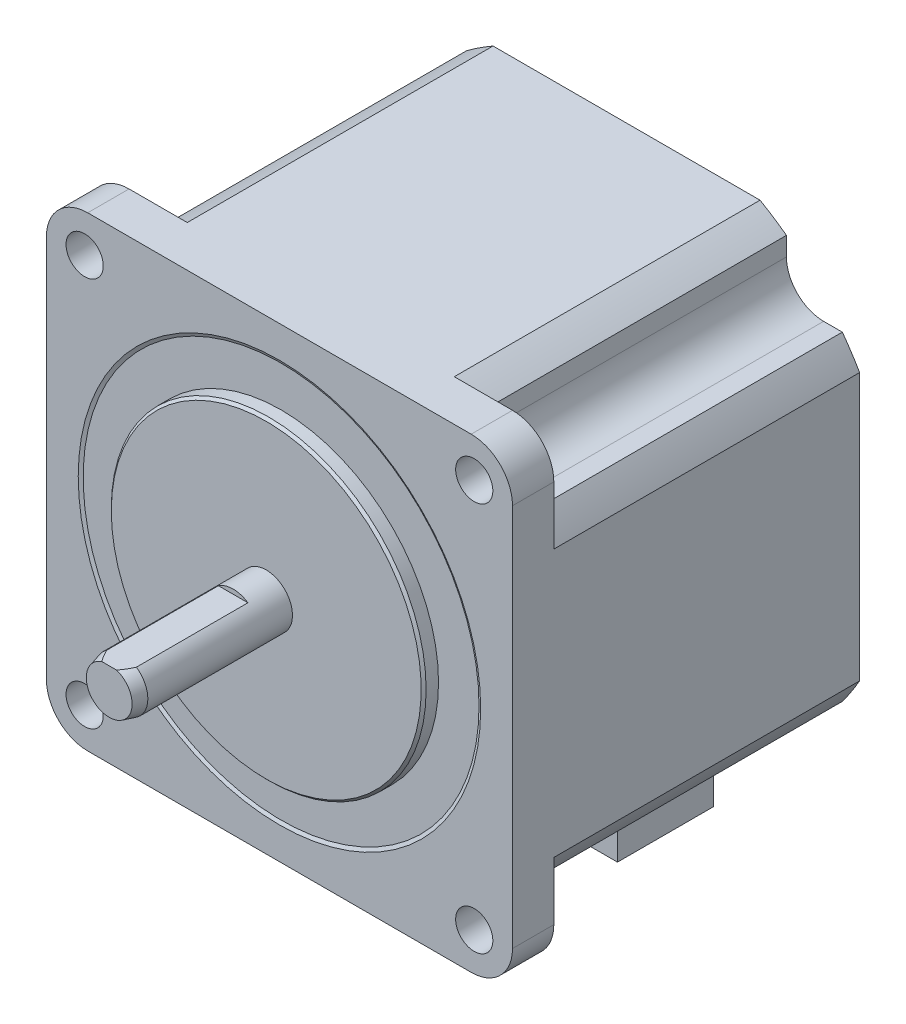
ISO-10303-21;
HEADER;
FILE_DESCRIPTION(('STEP AP214'),'2;1');
FILE_NAME('part.step','',(''),(''),'','','');
FILE_SCHEMA(('AUTOMOTIVE_DESIGN { 1 0 10303 214 1 1 1 1 }'));
ENDSEC;
DATA;
#1=APPLICATION_CONTEXT('core data for automotive mechanical design processes');
#2=APPLICATION_PROTOCOL_DEFINITION('international standard','automotive_design',2000,#1);
#3=PRODUCT_CONTEXT('',#1,'mechanical');
#4=PRODUCT('Part','Part','',(#3));
#5=PRODUCT_RELATED_PRODUCT_CATEGORY('part','',(#4));
#6=PRODUCT_DEFINITION_FORMATION('','',#4);
#7=PRODUCT_DEFINITION_CONTEXT('part definition',#1,'design');
#8=PRODUCT_DEFINITION('design','',#6,#7);
#9=PRODUCT_DEFINITION_SHAPE('','',#8);
#10=(LENGTH_UNIT() NAMED_UNIT(*) SI_UNIT(.MILLI.,.METRE.));
#11=(NAMED_UNIT(*) PLANE_ANGLE_UNIT() SI_UNIT($,.RADIAN.));
#12=(NAMED_UNIT(*) SI_UNIT($,.STERADIAN.) SOLID_ANGLE_UNIT());
#13=UNCERTAINTY_MEASURE_WITH_UNIT(LENGTH_MEASURE(1.E-05),#10,'distance_accuracy_value','');
#14=(GEOMETRIC_REPRESENTATION_CONTEXT(3) GLOBAL_UNCERTAINTY_ASSIGNED_CONTEXT((#13)) GLOBAL_UNIT_ASSIGNED_CONTEXT((#10,
#11,#12)) REPRESENTATION_CONTEXT('',''));
#15=CARTESIAN_POINT('',(0.,0.,0.));
#16=DIRECTION('',(0.,0.,1.));
#17=DIRECTION('',(1.,0.,0.));
#18=AXIS2_PLACEMENT_3D('',#15,#16,#17);
#19=CARTESIAN_POINT('',(0.,0.,-43.6));
#20=DIRECTION('',(0.,0.,-1.));
#21=DIRECTION('',(-1.,0.,0.));
#22=AXIS2_PLACEMENT_3D('',#19,#20,#21);
#23=PLANE('',#22);
#24=DIRECTION('',(0.,1.,0.));
#25=VECTOR('',#24,1.);
#26=CARTESIAN_POINT('',(-28.2,0.,-43.6));
#27=LINE('',#26,#25);
#28=CARTESIAN_POINT('',(-28.2,-16.1558039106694,-43.6));
#29=VERTEX_POINT('',#28);
#30=CARTESIAN_POINT('',(-28.2,16.1558039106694,-43.6));
#31=VERTEX_POINT('',#30);
#32=EDGE_CURVE('E370',#29,#31,#27,.T.);
#33=ORIENTED_EDGE('',*,*,#32,.T.);
#34=CARTESIAN_POINT('',(0.,0.,-43.6));
#35=DIRECTION('',(0.,0.,-1.));
#36=DIRECTION('',(-1.,0.,0.));
#37=AXIS2_PLACEMENT_3D('',#34,#35,#36);
#38=CIRCLE('',#37,32.5);
#39=CARTESIAN_POINT('',(-26.1118268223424,19.35,-43.6));
#40=VERTEX_POINT('',#39);
#41=EDGE_CURVE('E373',#31,#40,#38,.T.);
#42=ORIENTED_EDGE('',*,*,#41,.T.);
#43=DIRECTION('',(-1.,0.,0.));
#44=VECTOR('',#43,1.);
#45=CARTESIAN_POINT('',(0.,19.3500000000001,-43.6));
#46=LINE('',#45,#44);
#47=CARTESIAN_POINT('',(-23.85,19.35,-43.6));
#48=VERTEX_POINT('',#47);
#49=EDGE_CURVE('E377',#48,#40,#46,.T.);
#50=ORIENTED_EDGE('',*,*,#49,.F.);
#51=CARTESIAN_POINT('',(-23.85,23.85,-43.6));
#52=DIRECTION('',(0.,0.,-1.));
#53=DIRECTION('',(-1.,0.,0.));
#54=AXIS2_PLACEMENT_3D('',#51,#52,#53);
#55=CIRCLE('',#54,4.5);
#56=CARTESIAN_POINT('',(-19.35,23.85,-43.6));
#57=VERTEX_POINT('',#56);
#58=EDGE_CURVE('E501',#48,#57,#55,.F.);
#59=ORIENTED_EDGE('',*,*,#58,.T.);
#60=DIRECTION('',(0.,-1.,0.));
#61=VECTOR('',#60,1.);
#62=CARTESIAN_POINT('',(-19.35,0.,-43.6));
#63=LINE('',#62,#61);
#64=CARTESIAN_POINT('',(-19.35,26.1118268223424,-43.6));
#65=VERTEX_POINT('',#64);
#66=EDGE_CURVE('E381',#65,#57,#63,.T.);
#67=ORIENTED_EDGE('',*,*,#66,.F.);
#68=CARTESIAN_POINT('',(-16.1558039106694,28.2,-43.6));
#69=VERTEX_POINT('',#68);
#70=EDGE_CURVE('E379',#65,#69,#38,.T.);
#71=ORIENTED_EDGE('',*,*,#70,.T.);
#72=DIRECTION('',(1.,0.,0.));
#73=VECTOR('',#72,1.);
#74=CARTESIAN_POINT('',(0.,28.2,-43.6));
#75=LINE('',#74,#73);
#76=CARTESIAN_POINT('',(16.1558039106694,28.2,-43.6));
#77=VERTEX_POINT('',#76);
#78=EDGE_CURVE('E384',#69,#77,#75,.T.);
#79=ORIENTED_EDGE('',*,*,#78,.T.);
#80=CARTESIAN_POINT('',(19.35,26.1118268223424,-43.6));
#81=VERTEX_POINT('',#80);
#82=EDGE_CURVE('E386',#77,#81,#38,.T.);
#83=ORIENTED_EDGE('',*,*,#82,.T.);
#84=DIRECTION('',(0.,-1.,0.));
#85=VECTOR('',#84,1.);
#86=CARTESIAN_POINT('',(19.35,0.,-43.6));
#87=LINE('',#86,#85);
#88=CARTESIAN_POINT('',(19.35,23.85,-43.6));
#89=VERTEX_POINT('',#88);
#90=EDGE_CURVE('E387',#81,#89,#87,.T.);
#91=ORIENTED_EDGE('',*,*,#90,.T.);
#92=CARTESIAN_POINT('',(23.85,23.85,-43.6));
#93=DIRECTION('',(0.,0.,-1.));
#94=DIRECTION('',(-1.,0.,0.));
#95=AXIS2_PLACEMENT_3D('',#92,#93,#94);
#96=CIRCLE('',#95,4.5);
#97=CARTESIAN_POINT('',(23.85,19.35,-43.6));
#98=VERTEX_POINT('',#97);
#99=EDGE_CURVE('E503',#89,#98,#96,.F.);
#100=ORIENTED_EDGE('',*,*,#99,.T.);
#101=DIRECTION('',(-1.,0.,0.));
#102=VECTOR('',#101,1.);
#103=CARTESIAN_POINT('',(0.,19.3500000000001,-43.6));
#104=LINE('',#103,#102);
#105=CARTESIAN_POINT('',(26.1118268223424,19.35,-43.6));
#106=VERTEX_POINT('',#105);
#107=EDGE_CURVE('E390',#106,#98,#104,.T.);
#108=ORIENTED_EDGE('',*,*,#107,.F.);
#109=CARTESIAN_POINT('',(28.2,16.1558039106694,-43.6));
#110=VERTEX_POINT('',#109);
#111=EDGE_CURVE('E393',#106,#110,#38,.T.);
#112=ORIENTED_EDGE('',*,*,#111,.T.);
#113=DIRECTION('',(0.,-1.,0.));
#114=VECTOR('',#113,1.);
#115=CARTESIAN_POINT('',(28.2,0.,-43.6));
#116=LINE('',#115,#114);
#117=CARTESIAN_POINT('',(28.2,-16.1558039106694,-43.6));
#118=VERTEX_POINT('',#117);
#119=EDGE_CURVE('E394',#110,#118,#116,.T.);
#120=ORIENTED_EDGE('',*,*,#119,.T.);
#121=CARTESIAN_POINT('',(26.1118268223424,-19.35,-43.6));
#122=VERTEX_POINT('',#121);
#123=EDGE_CURVE('E396',#118,#122,#38,.T.);
#124=ORIENTED_EDGE('',*,*,#123,.T.);
#125=DIRECTION('',(-1.,0.,0.));
#126=VECTOR('',#125,1.);
#127=CARTESIAN_POINT('',(0.,-19.3499999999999,-43.6));
#128=LINE('',#127,#126);
#129=CARTESIAN_POINT('',(23.85,-19.35,-43.6));
#130=VERTEX_POINT('',#129);
#131=EDGE_CURVE('E397',#122,#130,#128,.T.);
#132=ORIENTED_EDGE('',*,*,#131,.T.);
#133=CARTESIAN_POINT('',(23.85,-23.85,-43.6));
#134=DIRECTION('',(0.,0.,-1.));
#135=DIRECTION('',(-1.,0.,0.));
#136=AXIS2_PLACEMENT_3D('',#133,#134,#135);
#137=CIRCLE('',#136,4.5);
#138=CARTESIAN_POINT('',(19.35,-23.85,-43.6));
#139=VERTEX_POINT('',#138);
#140=EDGE_CURVE('E497',#130,#139,#137,.F.);
#141=ORIENTED_EDGE('',*,*,#140,.T.);
#142=DIRECTION('',(0.,-1.,0.));
#143=VECTOR('',#142,1.);
#144=CARTESIAN_POINT('',(19.35,0.,-43.6));
#145=LINE('',#144,#143);
#146=CARTESIAN_POINT('',(19.35,-26.1118268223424,-43.6));
#147=VERTEX_POINT('',#146);
#148=EDGE_CURVE('E400',#139,#147,#145,.T.);
#149=ORIENTED_EDGE('',*,*,#148,.T.);
#150=CARTESIAN_POINT('',(16.1558039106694,-28.2,-43.6));
#151=VERTEX_POINT('',#150);
#152=EDGE_CURVE('E402',#147,#151,#38,.T.);
#153=ORIENTED_EDGE('',*,*,#152,.T.);
#154=DIRECTION('',(-1.,0.,0.));
#155=VECTOR('',#154,1.);
#156=CARTESIAN_POINT('',(0.,-28.2,-43.6));
#157=LINE('',#156,#155);
#158=CARTESIAN_POINT('',(10.5,-28.2,-43.6));
#159=VERTEX_POINT('',#158);
#160=EDGE_CURVE('E403',#151,#159,#157,.T.);
#161=ORIENTED_EDGE('',*,*,#160,.T.);
#162=DIRECTION('',(0.,1.,0.));
#163=VECTOR('',#162,1.);
#164=CARTESIAN_POINT('',(10.5,-38.2,-43.6));
#165=LINE('',#164,#163);
#166=CARTESIAN_POINT('',(10.5,-38.2,-43.6));
#167=VERTEX_POINT('',#166);
#168=EDGE_CURVE('E364',#167,#159,#165,.T.);
#169=ORIENTED_EDGE('',*,*,#168,.F.);
#170=DIRECTION('',(1.,0.,0.));
#171=VECTOR('',#170,1.);
#172=CARTESIAN_POINT('',(-10.5,-38.2,-43.6));
#173=LINE('',#172,#171);
#174=CARTESIAN_POINT('',(-10.5,-38.2,-43.6));
#175=VERTEX_POINT('',#174);
#176=EDGE_CURVE('E347',#175,#167,#173,.T.);
#177=ORIENTED_EDGE('',*,*,#176,.F.);
#178=DIRECTION('',(0.,1.,0.));
#179=VECTOR('',#178,1.);
#180=CARTESIAN_POINT('',(-10.5,-38.2,-43.6));
#181=LINE('',#180,#179);
#182=CARTESIAN_POINT('',(-10.5,-28.2,-43.6));
#183=VERTEX_POINT('',#182);
#184=EDGE_CURVE('E366',#175,#183,#181,.T.);
#185=ORIENTED_EDGE('',*,*,#184,.T.);
#186=CARTESIAN_POINT('',(-16.1558039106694,-28.2,-43.6));
#187=VERTEX_POINT('',#186);
#188=EDGE_CURVE('E407',#183,#187,#157,.T.);
#189=ORIENTED_EDGE('',*,*,#188,.T.);
#190=CARTESIAN_POINT('',(-19.35,-26.1118268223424,-43.6));
#191=VERTEX_POINT('',#190);
#192=EDGE_CURVE('E406',#187,#191,#38,.T.);
#193=ORIENTED_EDGE('',*,*,#192,.T.);
#194=DIRECTION('',(0.,-1.,0.));
#195=VECTOR('',#194,1.);
#196=CARTESIAN_POINT('',(-19.35,0.,-43.6));
#197=LINE('',#196,#195);
#198=CARTESIAN_POINT('',(-19.35,-23.85,-43.6));
#199=VERTEX_POINT('',#198);
#200=EDGE_CURVE('E408',#199,#191,#197,.T.);
#201=ORIENTED_EDGE('',*,*,#200,.F.);
#202=CARTESIAN_POINT('',(-23.85,-23.85,-43.6));
#203=DIRECTION('',(0.,0.,-1.));
#204=DIRECTION('',(-1.,0.,0.));
#205=AXIS2_PLACEMENT_3D('',#202,#203,#204);
#206=CIRCLE('',#205,4.5);
#207=CARTESIAN_POINT('',(-23.85,-19.35,-43.6));
#208=VERTEX_POINT('',#207);
#209=EDGE_CURVE('E499',#199,#208,#206,.F.);
#210=ORIENTED_EDGE('',*,*,#209,.T.);
#211=DIRECTION('',(-1.,0.,0.));
#212=VECTOR('',#211,1.);
#213=CARTESIAN_POINT('',(0.,-19.35,-43.6));
#214=LINE('',#213,#212);
#215=CARTESIAN_POINT('',(-26.1118268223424,-19.35,-43.6));
#216=VERTEX_POINT('',#215);
#217=EDGE_CURVE('E410',#208,#216,#214,.T.);
#218=ORIENTED_EDGE('',*,*,#217,.T.);
#219=EDGE_CURVE('E378',#216,#29,#38,.T.);
#220=ORIENTED_EDGE('',*,*,#219,.T.);
#221=EDGE_LOOP('',(#33,#42,#50,#59,#67,#71,#79,#83,#91,#100,#108,#112,#120,#124,#132,#141,#149,
#153,#161,#169,#177,#185,#189,#193,#201,#210,#218,#220));
#222=FACE_BOUND('',#221,.T.);
#223=CARTESIAN_POINT('',(0.,0.,-43.6));
#224=DIRECTION('',(0.,0.,-1.));
#225=DIRECTION('',(-1.,0.,0.));
#226=AXIS2_PLACEMENT_3D('',#223,#224,#225);
#227=CIRCLE('',#226,3.175);
#228=CARTESIAN_POINT('',(-3.175,0.,-43.6));
#229=VERTEX_POINT('',#228);
#230=EDGE_CURVE('E310',#229,#229,#227,.T.);
#231=ORIENTED_EDGE('',*,*,#230,.F.);
#232=EDGE_LOOP('',(#231));
#233=FACE_BOUND('',#232,.T.);
#234=ADVANCED_FACE('F38',(#222,#233),#23,.T.);
#235=CARTESIAN_POINT('',(0.,0.,19.));
#236=DIRECTION('',(0.,0.,-1.));
#237=DIRECTION('',(-1.,0.,0.));
#238=AXIS2_PLACEMENT_3D('',#235,#236,#237);
#239=CYLINDRICAL_SURFACE('',#238,3.175);
#240=CARTESIAN_POINT('',(0.,0.,17.5));
#241=DIRECTION('',(0.,0.,1.));
#242=DIRECTION('',(1.,0.,0.));
#243=AXIS2_PLACEMENT_3D('',#240,#241,#242);
#244=CIRCLE('',#243,3.175);
#245=CARTESIAN_POINT('',(1.78605710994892,2.625,17.500000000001));
#246=VERTEX_POINT('',#245);
#247=CARTESIAN_POINT('',(-1.78605710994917,2.625,17.5));
#248=VERTEX_POINT('',#247);
#249=EDGE_CURVE('E508',#246,#248,#244,.F.);
#250=ORIENTED_EDGE('',*,*,#249,.T.);
#251=DIRECTION('',(0.,0.,-1.));
#252=VECTOR('',#251,1.);
#253=CARTESIAN_POINT('',(-1.78605710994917,2.625,19.));
#254=LINE('',#253,#252);
#255=CARTESIAN_POINT('',(-1.78605710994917,2.625,4.));
#256=VERTEX_POINT('',#255);
#257=EDGE_CURVE('E340',#248,#256,#254,.T.);
#258=ORIENTED_EDGE('',*,*,#257,.T.);
#259=CARTESIAN_POINT('',(0.,0.,4.));
#260=DIRECTION('',(0.,0.,1.));
#261=DIRECTION('',(1.,0.,0.));
#262=AXIS2_PLACEMENT_3D('',#259,#260,#261);
#263=CIRCLE('',#262,3.175);
#264=CARTESIAN_POINT('',(1.78605710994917,2.625,4.));
#265=VERTEX_POINT('',#264);
#266=EDGE_CURVE('E519',#265,#256,#263,.T.);
#267=ORIENTED_EDGE('',*,*,#266,.F.);
#268=DIRECTION('',(0.,0.,-1.));
#269=VECTOR('',#268,1.);
#270=CARTESIAN_POINT('',(1.78605710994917,2.625,19.));
#271=LINE('',#270,#269);
#272=EDGE_CURVE('E336',#265,#246,#271,.F.);
#273=ORIENTED_EDGE('',*,*,#272,.T.);
#274=EDGE_LOOP('',(#250,#258,#267,#273));
#275=FACE_BOUND('',#274,.T.);
#276=CARTESIAN_POINT('',(0.,0.,0.));
#277=DIRECTION('',(0.,0.,-1.));
#278=DIRECTION('',(-1.,0.,0.));
#279=AXIS2_PLACEMENT_3D('',#276,#277,#278);
#280=CIRCLE('',#279,3.175);
#281=CARTESIAN_POINT('',(-3.175,0.,0.));
#282=VERTEX_POINT('',#281);
#283=EDGE_CURVE('E807',#282,#282,#280,.T.);
#284=ORIENTED_EDGE('',*,*,#283,.F.);
#285=EDGE_LOOP('',(#284));
#286=FACE_BOUND('',#285,.T.);
#287=ADVANCED_FACE('F556',(#275,#286),#239,.T.);
#288=CARTESIAN_POINT('',(0.,0.,19.));
#289=DIRECTION('',(0.,0.,1.));
#290=DIRECTION('',(1.,0.,0.));
#291=AXIS2_PLACEMENT_3D('',#288,#289,#290);
#292=PLANE('',#291);
#293=DIRECTION('',(1.,0.,0.));
#294=VECTOR('',#293,1.);
#295=CARTESIAN_POINT('',(-4.72781232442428,2.625,19.));
#296=LINE('',#295,#294);
#297=CARTESIAN_POINT('',(-0.89405071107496,2.625,19.));
#298=VERTEX_POINT('',#297);
#299=CARTESIAN_POINT('',(0.89405071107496,2.625,19.));
#300=VERTEX_POINT('',#299);
#301=EDGE_CURVE('E332',#298,#300,#296,.T.);
#302=ORIENTED_EDGE('',*,*,#301,.F.);
#303=CARTESIAN_POINT('',(0.,0.,19.));
#304=DIRECTION('',(0.,0.,1.));
#305=DIRECTION('',(1.,0.,0.));
#306=AXIS2_PLACEMENT_3D('',#303,#304,#305);
#307=CIRCLE('',#306,2.77307621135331);
#308=EDGE_CURVE('E505',#298,#300,#307,.T.);
#309=ORIENTED_EDGE('',*,*,#308,.T.);
#310=EDGE_LOOP('',(#302,#309));
#311=FACE_BOUND('',#310,.T.);
#312=ADVANCED_FACE('F651',(#311),#292,.T.);
#313=CARTESIAN_POINT('',(0.,0.,0.));
#314=DIRECTION('',(0.,0.,-1.));
#315=DIRECTION('',(-1.,0.,0.));
#316=AXIS2_PLACEMENT_3D('',#313,#314,#315);
#317=PLANE('',#316);
#318=CARTESIAN_POINT('',(0.,0.,0.));
#319=DIRECTION('',(0.,0.,-1.));
#320=DIRECTION('',(-1.,0.,0.));
#321=AXIS2_PLACEMENT_3D('',#318,#319,#320);
#322=CIRCLE('',#321,18.75);
#323=CARTESIAN_POINT('',(-18.75,0.,0.));
#324=VERTEX_POINT('',#323);
#325=EDGE_CURVE('E1360',#324,#324,#322,.F.);
#326=ORIENTED_EDGE('',*,*,#325,.T.);
#327=EDGE_LOOP('',(#326));
#328=FACE_BOUND('',#327,.T.);
#329=ORIENTED_EDGE('',*,*,#283,.T.);
#330=EDGE_LOOP('',(#329));
#331=FACE_BOUND('',#330,.T.);
#332=ADVANCED_FACE('F647',(#328,#331),#317,.F.);
#333=CARTESIAN_POINT('',(0.,0.,-1.6));
#334=DIRECTION('',(0.,0.,1.));
#335=DIRECTION('',(1.,0.,0.));
#336=AXIS2_PLACEMENT_3D('',#333,#334,#335);
#337=CYLINDRICAL_SURFACE('',#336,19.05);
#338=CARTESIAN_POINT('',(0.,0.,-0.299999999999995));
#339=DIRECTION('',(0.,0.,-1.));
#340=DIRECTION('',(-1.,0.,0.));
#341=AXIS2_PLACEMENT_3D('',#338,#339,#340);
#342=CIRCLE('',#341,19.05);
#343=CARTESIAN_POINT('',(-19.05,0.,-0.299999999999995));
#344=VERTEX_POINT('',#343);
#345=EDGE_CURVE('E1363',#344,#344,#342,.T.);
#346=ORIENTED_EDGE('',*,*,#345,.T.);
#347=EDGE_LOOP('',(#346));
#348=FACE_BOUND('',#347,.T.);
#349=CARTESIAN_POINT('',(0.,0.,-1.8));
#350=DIRECTION('',(0.,0.,1.));
#351=DIRECTION('',(1.,0.,0.));
#352=AXIS2_PLACEMENT_3D('',#349,#350,#351);
#353=CIRCLE('',#352,19.05);
#354=CARTESIAN_POINT('',(19.05,0.,-1.8));
#355=VERTEX_POINT('',#354);
#356=EDGE_CURVE('E326',#355,#355,#353,.T.);
#357=ORIENTED_EDGE('',*,*,#356,.T.);
#358=EDGE_LOOP('',(#357));
#359=FACE_BOUND('',#358,.T.);
#360=ADVANCED_FACE('F650',(#348,#359),#337,.T.);
#361=CARTESIAN_POINT('',(0.,0.,19.));
#362=DIRECTION('',(0.,0.,-1.));
#363=DIRECTION('',(-1.,0.,0.));
#364=AXIS2_PLACEMENT_3D('',#361,#362,#363);
#365=CONICAL_SURFACE('',#364,2.77307621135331,0.261799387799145);
#366=CARTESIAN_POINT('',(-3.30935894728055,2.625,13.5849436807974));
#367=CARTESIAN_POINT('',(-3.24542473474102,2.625,13.7718399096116));
#368=CARTESIAN_POINT('',(-3.180873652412,2.625,13.9585279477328));
#369=CARTESIAN_POINT('',(-3.05023975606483,2.625,14.3313889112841));
#370=CARTESIAN_POINT('',(-2.98415678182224,2.625,14.5175617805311));
#371=CARTESIAN_POINT('',(-2.85014549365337,2.625,14.8893346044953));
#372=CARTESIAN_POINT('',(-2.78221639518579,2.625,15.0749342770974));
#373=CARTESIAN_POINT('',(-2.64413585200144,2.625,15.445295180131));
#374=CARTESIAN_POINT('',(-2.57398453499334,2.625,15.630056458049));
#375=CARTESIAN_POINT('',(-2.43088450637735,2.625,15.9985625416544));
#376=CARTESIAN_POINT('',(-2.35793492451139,2.625,16.1823070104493));
#377=CARTESIAN_POINT('',(-2.20847433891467,2.625,16.5483836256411));
#378=CARTESIAN_POINT('',(-2.13196278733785,2.625,16.730715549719));
#379=CARTESIAN_POINT('',(-1.97412292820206,2.625,17.0936282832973));
#380=CARTESIAN_POINT('',(-1.89278731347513,2.625,17.2742059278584));
#381=CARTESIAN_POINT('',(-1.72367545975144,2.625,17.6322943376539));
#382=CARTESIAN_POINT('',(-1.63590163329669,2.625,17.8098062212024));
#383=CARTESIAN_POINT('',(-1.49689402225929,2.625,18.0727010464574));
#384=CARTESIAN_POINT('',(-1.44921905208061,2.625,18.159961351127));
#385=CARTESIAN_POINT('',(-1.3508144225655,2.625,18.3328001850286));
#386=CARTESIAN_POINT('',(-1.30008362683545,2.625,18.4183780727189));
#387=CARTESIAN_POINT('',(-1.19492866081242,2.625,18.5868191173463));
#388=CARTESIAN_POINT('',(-1.14051856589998,2.625,18.6696910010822));
#389=CARTESIAN_POINT('',(-1.02665023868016,2.625,18.8318604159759));
#390=CARTESIAN_POINT('',(-0.967196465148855,2.625,18.9111610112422));
#391=CARTESIAN_POINT('',(-0.862242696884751,2.625,19.0387203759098));
#392=CARTESIAN_POINT('',(-0.818661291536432,2.625,19.0885458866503));
#393=CARTESIAN_POINT('',(-0.727513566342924,2.625,19.1846578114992));
#394=CARTESIAN_POINT('',(-0.679939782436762,2.625,19.2309372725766));
#395=CARTESIAN_POINT('',(-0.579402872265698,2.625,19.3185048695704));
#396=CARTESIAN_POINT('',(-0.526387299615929,2.625,19.3597339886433));
#397=CARTESIAN_POINT('',(-0.414507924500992,2.625,19.4333493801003));
#398=CARTESIAN_POINT('',(-0.355665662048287,2.625,19.4657666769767));
#399=CARTESIAN_POINT('',(-0.254920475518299,2.625,19.5076037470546));
#400=CARTESIAN_POINT('',(-0.214733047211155,2.625,19.5210971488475));
#401=CARTESIAN_POINT('',(-0.132696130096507,2.625,19.5413023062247));
#402=CARTESIAN_POINT('',(-0.0908493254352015,2.625,19.5480245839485));
#403=CARTESIAN_POINT('',(-0.00641419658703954,2.625,19.5538691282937));
#404=CARTESIAN_POINT('',(0.0361766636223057,2.625,19.5529560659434));
#405=CARTESIAN_POINT('',(0.120530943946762,2.625,19.5435732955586));
#406=CARTESIAN_POINT('',(0.162293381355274,2.625,19.5350951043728));
#407=CARTESIAN_POINT('',(0.254092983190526,2.625,19.5086701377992));
#408=CARTESIAN_POINT('',(0.303590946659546,2.625,19.4888870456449));
#409=CARTESIAN_POINT('',(0.398827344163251,2.625,19.4417789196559));
#410=CARTESIAN_POINT('',(0.444557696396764,2.625,19.4144381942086));
#411=CARTESIAN_POINT('',(0.528152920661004,2.625,19.3573624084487));
#412=CARTESIAN_POINT('',(0.566351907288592,2.625,19.3281050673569));
#413=CARTESIAN_POINT('',(0.640136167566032,2.625,19.2664333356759));
#414=CARTESIAN_POINT('',(0.675718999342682,2.625,19.23401605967));
#415=CARTESIAN_POINT('',(0.74472099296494,2.625,19.1667643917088));
#416=CARTESIAN_POINT('',(0.77813283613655,2.625,19.1319225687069));
#417=CARTESIAN_POINT('',(0.842993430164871,2.625,19.0605004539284));
#418=CARTESIAN_POINT('',(0.874443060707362,2.625,19.0239209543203));
#419=CARTESIAN_POINT('',(0.960526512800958,2.625,18.9192141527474));
#420=CARTESIAN_POINT('',(1.01328788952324,2.625,18.8495504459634));
#421=CARTESIAN_POINT('',(1.11474355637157,2.625,18.7073019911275));
#422=CARTESIAN_POINT('',(1.16343498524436,2.625,18.6347152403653));
#423=CARTESIAN_POINT('',(1.25772470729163,2.625,18.4873519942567));
#424=CARTESIAN_POINT('',(1.30331615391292,2.625,18.4125711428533));
#425=CARTESIAN_POINT('',(1.39194135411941,2.625,18.2615031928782));
#426=CARTESIAN_POINT('',(1.43497467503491,2.625,18.1852158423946));
#427=CARTESIAN_POINT('',(1.56162993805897,2.625,17.9534626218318));
#428=CARTESIAN_POINT('',(1.64208680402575,2.625,17.7962698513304));
#429=CARTESIAN_POINT('',(1.79705705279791,2.625,17.4792970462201));
#430=CARTESIAN_POINT('',(1.87157841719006,2.625,17.3195208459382));
#431=CARTESIAN_POINT('',(2.0105464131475,2.625,17.0108615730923));
#432=CARTESIAN_POINT('',(2.07532251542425,2.625,16.8621261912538));
#433=CARTESIAN_POINT('',(2.20202359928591,2.625,16.5634427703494));
#434=CARTESIAN_POINT('',(2.26394842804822,2.625,16.4134946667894));
#435=CARTESIAN_POINT('',(2.44641955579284,2.625,15.962047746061));
#436=CARTESIAN_POINT('',(2.56356197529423,2.625,15.6591749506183));
#437=CARTESIAN_POINT('',(2.78774888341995,2.625,15.0616544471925));
#438=CARTESIAN_POINT('',(2.89500244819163,2.625,14.767084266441));
#439=CARTESIAN_POINT('',(3.0526461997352,2.625,14.3242983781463));
#440=CARTESIAN_POINT('',(3.10462177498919,2.625,14.1766447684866));
#441=CARTESIAN_POINT('',(3.20764960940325,2.625,13.881020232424));
#442=CARTESIAN_POINT('',(3.25870189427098,2.625,13.7330493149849));
#443=CARTESIAN_POINT('',(3.30935894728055,2.625,13.5849436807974));
#444=B_SPLINE_CURVE_WITH_KNOTS('',3,(#366,#367,#368,#369,#370,#371,#372,#373,#374,#375,#376,
#377,#378,#379,#380,#381,#382,#383,#384,#385,#386,#387,#388,#389,#390,#391,#392,#393,#394,#395,
#396,#397,#398,#399,#400,#401,#402,#403,#404,#405,#406,#407,#408,#409,#410,#411,#412,#413,#414,
#415,#416,#417,#418,#419,#420,#421,#422,#423,#424,#425,#426,#427,#428,#429,#430,#431,#432,#433,
#434,#435,#436,#437,#438,#439,#440,#441,#442,#443),.UNSPECIFIED.,.F.,.F.,(4,2,2,2,2,2,2,2,2,2,2,
2,2,2,2,2,2,2,2,2,2,2,2,2,2,2,2,2,2,2,2,2,2,2,2,2,2,2,4),(0.,0.592590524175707,1.18524331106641,
1.77815202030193,2.37102671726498,2.96408731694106,3.55723943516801,4.15131417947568,
4.74516743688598,5.04342777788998,5.34179972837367,5.63908859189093,5.93611732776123,
6.1345556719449,6.33337364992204,6.53432931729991,6.73456801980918,6.86126706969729,
6.9877689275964,7.11485643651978,7.24208663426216,7.40110146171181,7.56044895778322,
7.70458491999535,7.84885375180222,7.99358608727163,8.13825306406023,8.40019160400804,
8.66231276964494,8.92499521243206,9.18772195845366,9.71727649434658,10.2461064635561,
10.732753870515,11.2194273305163,12.1935231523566,13.1339513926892,13.6035521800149,
14.0731398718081),.UNSPECIFIED.);
#445=EDGE_CURVE('E518',#248,#298,#444,.T.);
#446=ORIENTED_EDGE('',*,*,#445,.F.);
#447=ORIENTED_EDGE('',*,*,#249,.F.);
#448=EDGE_CURVE('E511',#300,#246,#444,.T.);
#449=ORIENTED_EDGE('',*,*,#448,.F.);
#450=ORIENTED_EDGE('',*,*,#308,.F.);
#451=EDGE_LOOP('',(#446,#447,#449,#450));
#452=FACE_BOUND('',#451,.T.);
#453=ADVANCED_FACE('F521',(#452),#365,.T.);
#454=CARTESIAN_POINT('',(0.,0.,4.));
#455=DIRECTION('',(0.,0.,1.));
#456=DIRECTION('',(1.,0.,0.));
#457=AXIS2_PLACEMENT_3D('',#454,#455,#456);
#458=PLANE('',#457);
#459=ORIENTED_EDGE('',*,*,#266,.T.);
#460=DIRECTION('',(1.,0.,0.));
#461=VECTOR('',#460,1.);
#462=CARTESIAN_POINT('',(-4.72781232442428,2.625,4.));
#463=LINE('',#462,#461);
#464=EDGE_CURVE('E333',#256,#265,#463,.T.);
#465=ORIENTED_EDGE('',*,*,#464,.T.);
#466=EDGE_LOOP('',(#459,#465));
#467=FACE_BOUND('',#466,.T.);
#468=ADVANCED_FACE('F531',(#467),#458,.T.);
#469=CARTESIAN_POINT('',(-4.72781232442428,2.625,4.));
#470=DIRECTION('',(0.,-1.,0.));
#471=DIRECTION('',(0.,0.,-1.));
#472=AXIS2_PLACEMENT_3D('',#469,#470,#471);
#473=PLANE('',#472);
#474=ORIENTED_EDGE('',*,*,#445,.T.);
#475=ORIENTED_EDGE('',*,*,#301,.T.);
#476=ORIENTED_EDGE('',*,*,#448,.T.);
#477=ORIENTED_EDGE('',*,*,#272,.F.);
#478=ORIENTED_EDGE('',*,*,#464,.F.);
#479=ORIENTED_EDGE('',*,*,#257,.F.);
#480=EDGE_LOOP('',(#474,#475,#476,#477,#478,#479));
#481=FACE_BOUND('',#480,.T.);
#482=ADVANCED_FACE('F525',(#481),#473,.F.);
#483=CARTESIAN_POINT('',(0.,0.,-1.8));
#484=DIRECTION('',(0.,0.,1.));
#485=DIRECTION('',(1.,0.,0.));
#486=AXIS2_PLACEMENT_3D('',#483,#484,#485);
#487=PLANE('',#486);
#488=CARTESIAN_POINT('',(0.,0.,-1.8));
#489=DIRECTION('',(0.,0.,1.));
#490=DIRECTION('',(1.,0.,0.));
#491=AXIS2_PLACEMENT_3D('',#488,#489,#490);
#492=CIRCLE('',#491,23.95);
#493=CARTESIAN_POINT('',(23.95,0.,-1.8));
#494=VERTEX_POINT('',#493);
#495=EDGE_CURVE('E1365',#494,#494,#492,.T.);
#496=ORIENTED_EDGE('',*,*,#495,.T.);
#497=EDGE_LOOP('',(#496));
#498=FACE_BOUND('',#497,.T.);
#499=ORIENTED_EDGE('',*,*,#356,.F.);
#500=EDGE_LOOP('',(#499));
#501=FACE_BOUND('',#500,.T.);
#502=ADVANCED_FACE('F530',(#498,#501),#487,.T.);
#503=CARTESIAN_POINT('',(0.,-19.35,-43.6));
#504=DIRECTION('',(0.,1.,0.));
#505=DIRECTION('',(-1.,0.,0.));
#506=AXIS2_PLACEMENT_3D('',#503,#504,#505);
#507=PLANE('',#506);
#508=ORIENTED_EDGE('',*,*,#217,.F.);
#509=DIRECTION('',(0.,0.,1.));
#510=VECTOR('',#509,1.);
#511=CARTESIAN_POINT('',(-23.85,-19.35,-43.6));
#512=LINE('',#511,#510);
#513=CARTESIAN_POINT('',(-23.85,-19.35,-6.6));
#514=VERTEX_POINT('',#513);
#515=EDGE_CURVE('E476',#208,#514,#512,.T.);
#516=ORIENTED_EDGE('',*,*,#515,.T.);
#517=DIRECTION('',(-1.,0.,0.));
#518=VECTOR('',#517,1.);
#519=CARTESIAN_POINT('',(0.,-19.35,-6.6));
#520=LINE('',#519,#518);
#521=CARTESIAN_POINT('',(-26.1118268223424,-19.35,-6.6));
#522=VERTEX_POINT('',#521);
#523=EDGE_CURVE('E730',#514,#522,#520,.T.);
#524=ORIENTED_EDGE('',*,*,#523,.T.);
#525=DIRECTION('',(0.,0.,1.));
#526=VECTOR('',#525,1.);
#527=CARTESIAN_POINT('',(-26.1118268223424,-19.35,-43.6));
#528=LINE('',#527,#526);
#529=EDGE_CURVE('E717',#216,#522,#528,.T.);
#530=ORIENTED_EDGE('',*,*,#529,.F.);
#531=EDGE_LOOP('',(#508,#516,#524,#530));
#532=FACE_BOUND('',#531,.T.);
#533=ADVANCED_FACE('F565',(#532),#507,.F.);
#534=CARTESIAN_POINT('',(-23.85,-23.85,-43.6));
#535=DIRECTION('',(0.,0.,1.));
#536=DIRECTION('',(1.,0.,0.));
#537=AXIS2_PLACEMENT_3D('',#534,#535,#536);
#538=CYLINDRICAL_SURFACE('',#537,4.5);
#539=ORIENTED_EDGE('',*,*,#209,.F.);
#540=DIRECTION('',(0.,0.,1.));
#541=VECTOR('',#540,1.);
#542=CARTESIAN_POINT('',(-19.35,-23.85,-43.6));
#543=LINE('',#542,#541);
#544=CARTESIAN_POINT('',(-19.35,-23.85,-6.6));
#545=VERTEX_POINT('',#544);
#546=EDGE_CURVE('E481',#545,#199,#543,.F.);
#547=ORIENTED_EDGE('',*,*,#546,.F.);
#548=CARTESIAN_POINT('',(-23.85,-23.85,-6.6));
#549=DIRECTION('',(0.,0.,-1.));
#550=DIRECTION('',(-1.,0.,0.));
#551=AXIS2_PLACEMENT_3D('',#548,#549,#550);
#552=CIRCLE('',#551,4.5);
#553=EDGE_CURVE('E479',#514,#545,#552,.T.);
#554=ORIENTED_EDGE('',*,*,#553,.F.);
#555=ORIENTED_EDGE('',*,*,#515,.F.);
#556=EDGE_LOOP('',(#539,#547,#554,#555));
#557=FACE_BOUND('',#556,.T.);
#558=ADVANCED_FACE('F568',(#557),#538,.F.);
#559=CARTESIAN_POINT('',(-19.35,0.,-43.6));
#560=DIRECTION('',(-1.,0.,0.));
#561=DIRECTION('',(0.,-1.,0.));
#562=AXIS2_PLACEMENT_3D('',#559,#560,#561);
#563=PLANE('',#562);
#564=DIRECTION('',(0.,-1.,0.));
#565=VECTOR('',#564,1.);
#566=CARTESIAN_POINT('',(-19.35,0.,-6.6));
#567=LINE('',#566,#565);
#568=CARTESIAN_POINT('',(-19.35,-26.1118268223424,-6.6));
#569=VERTEX_POINT('',#568);
#570=EDGE_CURVE('E883',#545,#569,#567,.T.);
#571=ORIENTED_EDGE('',*,*,#570,.F.);
#572=ORIENTED_EDGE('',*,*,#546,.T.);
#573=ORIENTED_EDGE('',*,*,#200,.T.);
#574=DIRECTION('',(0.,0.,1.));
#575=VECTOR('',#574,1.);
#576=CARTESIAN_POINT('',(-19.35,-26.1118268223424,-43.6));
#577=LINE('',#576,#575);
#578=EDGE_CURVE('E721',#191,#569,#577,.T.);
#579=ORIENTED_EDGE('',*,*,#578,.T.);
#580=EDGE_LOOP('',(#571,#572,#573,#579));
#581=FACE_BOUND('',#580,.T.);
#582=ADVANCED_FACE('F570',(#581),#563,.T.);
#583=CARTESIAN_POINT('',(-19.35,0.,-43.6));
#584=DIRECTION('',(-1.,0.,0.));
#585=DIRECTION('',(0.,0.,1.));
#586=AXIS2_PLACEMENT_3D('',#583,#584,#585);
#587=PLANE('',#586);
#588=ORIENTED_EDGE('',*,*,#66,.T.);
#589=DIRECTION('',(0.,0.,1.));
#590=VECTOR('',#589,1.);
#591=CARTESIAN_POINT('',(-19.35,23.85,-6.6));
#592=LINE('',#591,#590);
#593=CARTESIAN_POINT('',(-19.35,23.85,-6.6));
#594=VERTEX_POINT('',#593);
#595=EDGE_CURVE('E483',#57,#594,#592,.T.);
#596=ORIENTED_EDGE('',*,*,#595,.T.);
#597=DIRECTION('',(0.,-1.,0.));
#598=VECTOR('',#597,1.);
#599=CARTESIAN_POINT('',(-19.35,0.,-6.6));
#600=LINE('',#599,#598);
#601=CARTESIAN_POINT('',(-19.35,26.1118268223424,-6.6));
#602=VERTEX_POINT('',#601);
#603=EDGE_CURVE('E462',#602,#594,#600,.T.);
#604=ORIENTED_EDGE('',*,*,#603,.F.);
#605=DIRECTION('',(0.,0.,1.));
#606=VECTOR('',#605,1.);
#607=CARTESIAN_POINT('',(-19.35,26.1118268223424,-43.6));
#608=LINE('',#607,#606);
#609=EDGE_CURVE('E465',#65,#602,#608,.T.);
#610=ORIENTED_EDGE('',*,*,#609,.F.);
#611=EDGE_LOOP('',(#588,#596,#604,#610));
#612=FACE_BOUND('',#611,.T.);
#613=ADVANCED_FACE('F573',(#612),#587,.T.);
#614=CARTESIAN_POINT('',(-23.85,23.85,-43.6));
#615=DIRECTION('',(0.,0.,-1.));
#616=DIRECTION('',(-1.,0.,0.));
#617=AXIS2_PLACEMENT_3D('',#614,#615,#616);
#618=CYLINDRICAL_SURFACE('',#617,4.5);
#619=ORIENTED_EDGE('',*,*,#58,.F.);
#620=DIRECTION('',(0.,0.,1.));
#621=VECTOR('',#620,1.);
#622=CARTESIAN_POINT('',(-23.85,19.35,-43.6));
#623=LINE('',#622,#621);
#624=CARTESIAN_POINT('',(-23.85,19.35,-6.6));
#625=VERTEX_POINT('',#624);
#626=EDGE_CURVE('E488',#625,#48,#623,.F.);
#627=ORIENTED_EDGE('',*,*,#626,.F.);
#628=CARTESIAN_POINT('',(-23.85,23.85,-6.6));
#629=DIRECTION('',(0.,0.,-1.));
#630=DIRECTION('',(-1.,0.,0.));
#631=AXIS2_PLACEMENT_3D('',#628,#629,#630);
#632=CIRCLE('',#631,4.5);
#633=EDGE_CURVE('E486',#594,#625,#632,.T.);
#634=ORIENTED_EDGE('',*,*,#633,.F.);
#635=ORIENTED_EDGE('',*,*,#595,.F.);
#636=EDGE_LOOP('',(#619,#627,#634,#635));
#637=FACE_BOUND('',#636,.T.);
#638=ADVANCED_FACE('F593',(#637),#618,.F.);
#639=CARTESIAN_POINT('',(0.,19.3500000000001,-43.6));
#640=DIRECTION('',(0.,1.,0.));
#641=DIRECTION('',(-1.,0.,0.));
#642=AXIS2_PLACEMENT_3D('',#639,#640,#641);
#643=PLANE('',#642);
#644=DIRECTION('',(-1.,0.,0.));
#645=VECTOR('',#644,1.);
#646=CARTESIAN_POINT('',(0.,19.3500000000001,-6.6));
#647=LINE('',#646,#645);
#648=CARTESIAN_POINT('',(-26.1118268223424,19.35,-6.6));
#649=VERTEX_POINT('',#648);
#650=EDGE_CURVE('E414',#625,#649,#647,.T.);
#651=ORIENTED_EDGE('',*,*,#650,.F.);
#652=ORIENTED_EDGE('',*,*,#626,.T.);
#653=ORIENTED_EDGE('',*,*,#49,.T.);
#654=DIRECTION('',(0.,0.,1.));
#655=VECTOR('',#654,1.);
#656=CARTESIAN_POINT('',(-26.1118268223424,19.35,-43.6));
#657=LINE('',#656,#655);
#658=EDGE_CURVE('E745',#40,#649,#657,.T.);
#659=ORIENTED_EDGE('',*,*,#658,.T.);
#660=EDGE_LOOP('',(#651,#652,#653,#659));
#661=FACE_BOUND('',#660,.T.);
#662=ADVANCED_FACE('F538',(#661),#643,.T.);
#663=CARTESIAN_POINT('',(0.,-38.2,0.));
#664=DIRECTION('',(0.,1.,0.));
#665=DIRECTION('',(0.,0.,1.));
#666=AXIS2_PLACEMENT_3D('',#663,#664,#665);
#667=PLANE('',#666);
#668=DIRECTION('',(0.,0.,-1.));
#669=VECTOR('',#668,1.);
#670=CARTESIAN_POINT('',(-10.5,-38.2,-43.6));
#671=LINE('',#670,#669);
#672=CARTESIAN_POINT('',(-10.5,-38.2,-32.));
#673=VERTEX_POINT('',#672);
#674=EDGE_CURVE('E344',#673,#175,#671,.T.);
#675=ORIENTED_EDGE('',*,*,#674,.T.);
#676=ORIENTED_EDGE('',*,*,#176,.T.);
#677=DIRECTION('',(0.,0.,1.));
#678=VECTOR('',#677,1.);
#679=CARTESIAN_POINT('',(10.5,-38.2,-43.6));
#680=LINE('',#679,#678);
#681=CARTESIAN_POINT('',(10.5,-38.2,-32.));
#682=VERTEX_POINT('',#681);
#683=EDGE_CURVE('E350',#167,#682,#680,.T.);
#684=ORIENTED_EDGE('',*,*,#683,.T.);
#685=DIRECTION('',(-1.,0.,0.));
#686=VECTOR('',#685,1.);
#687=CARTESIAN_POINT('',(-10.5,-38.2,-32.));
#688=LINE('',#687,#686);
#689=EDGE_CURVE('E352',#682,#673,#688,.T.);
#690=ORIENTED_EDGE('',*,*,#689,.T.);
#691=EDGE_LOOP('',(#675,#676,#684,#690));
#692=FACE_BOUND('',#691,.T.);
#693=ADVANCED_FACE('F534',(#692),#667,.F.);
#694=CARTESIAN_POINT('',(19.35,0.,-43.6));
#695=DIRECTION('',(-1.,0.,0.));
#696=DIRECTION('',(0.,-1.,0.));
#697=AXIS2_PLACEMENT_3D('',#694,#695,#696);
#698=PLANE('',#697);
#699=DIRECTION('',(0.,-1.,0.));
#700=VECTOR('',#699,1.);
#701=CARTESIAN_POINT('',(19.35,0.,-6.6));
#702=LINE('',#701,#700);
#703=CARTESIAN_POINT('',(19.35,26.1118268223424,-6.6));
#704=VERTEX_POINT('',#703);
#705=CARTESIAN_POINT('',(19.35,23.85,-6.6));
#706=VERTEX_POINT('',#705);
#707=EDGE_CURVE('E451',#704,#706,#702,.T.);
#708=ORIENTED_EDGE('',*,*,#707,.T.);
#709=DIRECTION('',(0.,0.,1.));
#710=VECTOR('',#709,1.);
#711=CARTESIAN_POINT('',(19.35,23.85,-43.6));
#712=LINE('',#711,#710);
#713=EDGE_CURVE('E495',#706,#89,#712,.F.);
#714=ORIENTED_EDGE('',*,*,#713,.T.);
#715=ORIENTED_EDGE('',*,*,#90,.F.);
#716=DIRECTION('',(0.,0.,1.));
#717=VECTOR('',#716,1.);
#718=CARTESIAN_POINT('',(19.35,26.1118268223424,-43.6));
#719=LINE('',#718,#717);
#720=EDGE_CURVE('E458',#81,#704,#719,.T.);
#721=ORIENTED_EDGE('',*,*,#720,.T.);
#722=EDGE_LOOP('',(#708,#714,#715,#721));
#723=FACE_BOUND('',#722,.T.);
#724=ADVANCED_FACE('F537',(#723),#698,.F.);
#725=CARTESIAN_POINT('',(23.85,23.85,-43.6));
#726=DIRECTION('',(0.,0.,1.));
#727=DIRECTION('',(1.,0.,0.));
#728=AXIS2_PLACEMENT_3D('',#725,#726,#727);
#729=CYLINDRICAL_SURFACE('',#728,4.5);
#730=ORIENTED_EDGE('',*,*,#99,.F.);
#731=ORIENTED_EDGE('',*,*,#713,.F.);
#732=CARTESIAN_POINT('',(23.85,23.85,-6.6));
#733=DIRECTION('',(0.,0.,-1.));
#734=DIRECTION('',(-1.,0.,0.));
#735=AXIS2_PLACEMENT_3D('',#732,#733,#734);
#736=CIRCLE('',#735,4.5);
#737=CARTESIAN_POINT('',(23.85,19.35,-6.6));
#738=VERTEX_POINT('',#737);
#739=EDGE_CURVE('E493',#738,#706,#736,.T.);
#740=ORIENTED_EDGE('',*,*,#739,.F.);
#741=DIRECTION('',(0.,0.,1.));
#742=VECTOR('',#741,1.);
#743=CARTESIAN_POINT('',(23.85,19.35,-43.6));
#744=LINE('',#743,#742);
#745=EDGE_CURVE('E490',#98,#738,#744,.T.);
#746=ORIENTED_EDGE('',*,*,#745,.F.);
#747=EDGE_LOOP('',(#730,#731,#740,#746));
#748=FACE_BOUND('',#747,.T.);
#749=ADVANCED_FACE('F586',(#748),#729,.F.);
#750=CARTESIAN_POINT('',(0.,19.3500000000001,-43.6));
#751=DIRECTION('',(0.,1.,0.));
#752=DIRECTION('',(-1.,0.,0.));
#753=AXIS2_PLACEMENT_3D('',#750,#751,#752);
#754=PLANE('',#753);
#755=ORIENTED_EDGE('',*,*,#107,.T.);
#756=ORIENTED_EDGE('',*,*,#745,.T.);
#757=DIRECTION('',(-1.,0.,0.));
#758=VECTOR('',#757,1.);
#759=CARTESIAN_POINT('',(0.,19.3500000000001,-6.6));
#760=LINE('',#759,#758);
#761=CARTESIAN_POINT('',(26.1118268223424,19.35,-6.6));
#762=VERTEX_POINT('',#761);
#763=EDGE_CURVE('E697',#762,#738,#760,.T.);
#764=ORIENTED_EDGE('',*,*,#763,.F.);
#765=DIRECTION('',(0.,0.,1.));
#766=VECTOR('',#765,1.);
#767=CARTESIAN_POINT('',(26.1118268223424,19.35,-43.6));
#768=LINE('',#767,#766);
#769=EDGE_CURVE('E695',#106,#762,#768,.T.);
#770=ORIENTED_EDGE('',*,*,#769,.F.);
#771=EDGE_LOOP('',(#755,#756,#764,#770));
#772=FACE_BOUND('',#771,.T.);
#773=ADVANCED_FACE('F582',(#772),#754,.T.);
#774=CARTESIAN_POINT('',(0.,-19.3499999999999,-43.6));
#775=DIRECTION('',(0.,1.,0.));
#776=DIRECTION('',(-1.,0.,0.));
#777=AXIS2_PLACEMENT_3D('',#774,#775,#776);
#778=PLANE('',#777);
#779=DIRECTION('',(-1.,0.,0.));
#780=VECTOR('',#779,1.);
#781=CARTESIAN_POINT('',(0.,-19.3499999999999,-6.6));
#782=LINE('',#781,#780);
#783=CARTESIAN_POINT('',(26.1118268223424,-19.35,-6.6));
#784=VERTEX_POINT('',#783);
#785=CARTESIAN_POINT('',(23.85,-19.35,-6.6));
#786=VERTEX_POINT('',#785);
#787=EDGE_CURVE('E884',#784,#786,#782,.T.);
#788=ORIENTED_EDGE('',*,*,#787,.T.);
#789=DIRECTION('',(0.,0.,1.));
#790=VECTOR('',#789,1.);
#791=CARTESIAN_POINT('',(23.85,-19.35,-43.6));
#792=LINE('',#791,#790);
#793=EDGE_CURVE('E474',#786,#130,#792,.F.);
#794=ORIENTED_EDGE('',*,*,#793,.T.);
#795=ORIENTED_EDGE('',*,*,#131,.F.);
#796=DIRECTION('',(0.,0.,1.));
#797=VECTOR('',#796,1.);
#798=CARTESIAN_POINT('',(26.1118268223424,-19.35,-43.6));
#799=LINE('',#798,#797);
#800=EDGE_CURVE('E736',#122,#784,#799,.T.);
#801=ORIENTED_EDGE('',*,*,#800,.T.);
#802=EDGE_LOOP('',(#788,#794,#795,#801));
#803=FACE_BOUND('',#802,.T.);
#804=ADVANCED_FACE('F579',(#803),#778,.F.);
#805=CARTESIAN_POINT('',(23.85,-23.85,-43.6));
#806=DIRECTION('',(0.,0.,-1.));
#807=DIRECTION('',(-1.,0.,0.));
#808=AXIS2_PLACEMENT_3D('',#805,#806,#807);
#809=CYLINDRICAL_SURFACE('',#808,4.5);
#810=ORIENTED_EDGE('',*,*,#140,.F.);
#811=ORIENTED_EDGE('',*,*,#793,.F.);
#812=CARTESIAN_POINT('',(23.85,-23.85,-6.6));
#813=DIRECTION('',(0.,0.,-1.));
#814=DIRECTION('',(-1.,0.,0.));
#815=AXIS2_PLACEMENT_3D('',#812,#813,#814);
#816=CIRCLE('',#815,4.5);
#817=CARTESIAN_POINT('',(19.35,-23.85,-6.6));
#818=VERTEX_POINT('',#817);
#819=EDGE_CURVE('E471',#818,#786,#816,.T.);
#820=ORIENTED_EDGE('',*,*,#819,.F.);
#821=DIRECTION('',(0.,0.,1.));
#822=VECTOR('',#821,1.);
#823=CARTESIAN_POINT('',(19.35,-23.85,-6.6));
#824=LINE('',#823,#822);
#825=EDGE_CURVE('E468',#139,#818,#824,.T.);
#826=ORIENTED_EDGE('',*,*,#825,.F.);
#827=EDGE_LOOP('',(#810,#811,#820,#826));
#828=FACE_BOUND('',#827,.T.);
#829=ADVANCED_FACE('F577',(#828),#809,.F.);
#830=CARTESIAN_POINT('',(19.35,0.,-43.6));
#831=DIRECTION('',(-1.,0.,0.));
#832=DIRECTION('',(0.,-1.,0.));
#833=AXIS2_PLACEMENT_3D('',#830,#831,#832);
#834=PLANE('',#833);
#835=ORIENTED_EDGE('',*,*,#148,.F.);
#836=ORIENTED_EDGE('',*,*,#825,.T.);
#837=DIRECTION('',(0.,-1.,0.));
#838=VECTOR('',#837,1.);
#839=CARTESIAN_POINT('',(19.35,0.,-6.6));
#840=LINE('',#839,#838);
#841=CARTESIAN_POINT('',(19.35,-26.1118268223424,-6.6));
#842=VERTEX_POINT('',#841);
#843=EDGE_CURVE('E881',#818,#842,#840,.T.);
#844=ORIENTED_EDGE('',*,*,#843,.T.);
#845=DIRECTION('',(0.,0.,1.));
#846=VECTOR('',#845,1.);
#847=CARTESIAN_POINT('',(19.35,-26.1118268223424,-43.6));
#848=LINE('',#847,#846);
#849=EDGE_CURVE('E733',#147,#842,#848,.T.);
#850=ORIENTED_EDGE('',*,*,#849,.F.);
#851=EDGE_LOOP('',(#835,#836,#844,#850));
#852=FACE_BOUND('',#851,.T.);
#853=ADVANCED_FACE('F562',(#852),#834,.F.);
#854=CARTESIAN_POINT('',(0.,0.,-43.6));
#855=DIRECTION('',(0.,0.,1.));
#856=DIRECTION('',(1.,0.,0.));
#857=AXIS2_PLACEMENT_3D('',#854,#855,#856);
#858=CYLINDRICAL_SURFACE('',#857,32.5);
#859=CARTESIAN_POINT('',(0.,0.,-6.6));
#860=DIRECTION('',(0.,0.,-1.));
#861=DIRECTION('',(-1.,0.,0.));
#862=AXIS2_PLACEMENT_3D('',#859,#860,#861);
#863=CIRCLE('',#862,32.5);
#864=CARTESIAN_POINT('',(-28.2,-16.1558039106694,-6.6));
#865=VERTEX_POINT('',#864);
#866=EDGE_CURVE('E374',#522,#865,#863,.T.);
#867=ORIENTED_EDGE('',*,*,#866,.T.);
#868=DIRECTION('',(0.,0.,1.));
#869=VECTOR('',#868,1.);
#870=CARTESIAN_POINT('',(-28.2,-16.1558039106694,-43.6));
#871=LINE('',#870,#869);
#872=EDGE_CURVE('E713',#29,#865,#871,.T.);
#873=ORIENTED_EDGE('',*,*,#872,.F.);
#874=ORIENTED_EDGE('',*,*,#219,.F.);
#875=ORIENTED_EDGE('',*,*,#529,.T.);
#876=EDGE_LOOP('',(#867,#873,#874,#875));
#877=FACE_BOUND('',#876,.T.);
#878=ADVANCED_FACE('F558',(#877),#858,.T.);
#879=CARTESIAN_POINT('',(-28.2,16.1558039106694,-6.6));
#880=VERTEX_POINT('',#879);
#881=EDGE_CURVE('E369',#880,#649,#863,.T.);
#882=ORIENTED_EDGE('',*,*,#881,.T.);
#883=ORIENTED_EDGE('',*,*,#658,.F.);
#884=ORIENTED_EDGE('',*,*,#41,.F.);
#885=DIRECTION('',(0.,0.,1.));
#886=VECTOR('',#885,1.);
#887=CARTESIAN_POINT('',(-28.2,16.1558039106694,-43.6));
#888=LINE('',#887,#886);
#889=EDGE_CURVE('E748',#31,#880,#888,.T.);
#890=ORIENTED_EDGE('',*,*,#889,.T.);
#891=EDGE_LOOP('',(#882,#883,#884,#890));
#892=FACE_BOUND('',#891,.T.);
#893=ADVANCED_FACE('F561',(#892),#858,.T.);
#894=CARTESIAN_POINT('',(-16.1558039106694,28.2,-6.6));
#895=VERTEX_POINT('',#894);
#896=EDGE_CURVE('E452',#602,#895,#863,.T.);
#897=ORIENTED_EDGE('',*,*,#896,.T.);
#898=DIRECTION('',(0.,0.,1.));
#899=VECTOR('',#898,1.);
#900=CARTESIAN_POINT('',(-16.1558039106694,28.2,-43.6));
#901=LINE('',#900,#899);
#902=EDGE_CURVE('E457',#69,#895,#901,.T.);
#903=ORIENTED_EDGE('',*,*,#902,.F.);
#904=ORIENTED_EDGE('',*,*,#70,.F.);
#905=ORIENTED_EDGE('',*,*,#609,.T.);
#906=EDGE_LOOP('',(#897,#903,#904,#905));
#907=FACE_BOUND('',#906,.T.);
#908=ADVANCED_FACE('F907',(#907),#858,.T.);
#909=CARTESIAN_POINT('',(16.1558039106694,28.2,-6.6));
#910=VERTEX_POINT('',#909);
#911=EDGE_CURVE('E447',#910,#704,#863,.T.);
#912=ORIENTED_EDGE('',*,*,#911,.T.);
#913=ORIENTED_EDGE('',*,*,#720,.F.);
#914=ORIENTED_EDGE('',*,*,#82,.F.);
#915=DIRECTION('',(0.,0.,1.));
#916=VECTOR('',#915,1.);
#917=CARTESIAN_POINT('',(16.1558039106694,28.2,-43.6));
#918=LINE('',#917,#916);
#919=EDGE_CURVE('E454',#77,#910,#918,.T.);
#920=ORIENTED_EDGE('',*,*,#919,.T.);
#921=EDGE_LOOP('',(#912,#913,#914,#920));
#922=FACE_BOUND('',#921,.T.);
#923=ADVANCED_FACE('F622',(#922),#858,.T.);
#924=CARTESIAN_POINT('',(-28.2,-28.2,-6.6));
#925=DIRECTION('',(0.,0.,-1.));
#926=DIRECTION('',(-1.,0.,0.));
#927=AXIS2_PLACEMENT_3D('',#924,#925,#926);
#928=PLANE('',#927);
#929=ORIENTED_EDGE('',*,*,#603,.T.);
#930=ORIENTED_EDGE('',*,*,#633,.T.);
#931=ORIENTED_EDGE('',*,*,#650,.T.);
#932=ORIENTED_EDGE('',*,*,#881,.F.);
#933=DIRECTION('',(0.,1.,0.));
#934=VECTOR('',#933,1.);
#935=CARTESIAN_POINT('',(-28.2,28.2,-6.6));
#936=LINE('',#935,#934);
#937=CARTESIAN_POINT('',(-28.2,23.2,-6.6));
#938=VERTEX_POINT('',#937);
#939=EDGE_CURVE('E780',#880,#938,#936,.T.);
#940=ORIENTED_EDGE('',*,*,#939,.T.);
#941=CARTESIAN_POINT('',(-23.2,23.2,-6.6));
#942=DIRECTION('',(0.,0.,-1.));
#943=DIRECTION('',(-1.,0.,0.));
#944=AXIS2_PLACEMENT_3D('',#941,#942,#943);
#945=CIRCLE('',#944,5.);
#946=CARTESIAN_POINT('',(-23.2,28.2,-6.6));
#947=VERTEX_POINT('',#946);
#948=EDGE_CURVE('E832',#938,#947,#945,.T.);
#949=ORIENTED_EDGE('',*,*,#948,.T.);
#950=DIRECTION('',(1.,0.,0.));
#951=VECTOR('',#950,1.);
#952=CARTESIAN_POINT('',(28.2,28.2,-6.6));
#953=LINE('',#952,#951);
#954=EDGE_CURVE('E850',#947,#895,#953,.T.);
#955=ORIENTED_EDGE('',*,*,#954,.T.);
#956=ORIENTED_EDGE('',*,*,#896,.F.);
#957=EDGE_LOOP('',(#929,#930,#931,#932,#940,#949,#955,#956));
#958=FACE_BOUND('',#957,.T.);
#959=CARTESIAN_POINT('',(-23.57,23.57,-6.6));
#960=DIRECTION('',(0.,0.,-1.));
#961=DIRECTION('',(-1.,0.,0.));
#962=AXIS2_PLACEMENT_3D('',#959,#960,#961);
#963=CIRCLE('',#962,2.25);
#964=CARTESIAN_POINT('',(-25.82,23.57,-6.6));
#965=VERTEX_POINT('',#964);
#966=EDGE_CURVE('E768',#965,#965,#963,.T.);
#967=ORIENTED_EDGE('',*,*,#966,.F.);
#968=EDGE_LOOP('',(#967));
#969=FACE_BOUND('',#968,.T.);
#970=ADVANCED_FACE('F618',(#958,#969),#928,.T.);
#971=CARTESIAN_POINT('',(28.2,16.1558039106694,-6.6));
#972=VERTEX_POINT('',#971);
#973=EDGE_CURVE('E443',#762,#972,#863,.T.);
#974=ORIENTED_EDGE('',*,*,#973,.T.);
#975=DIRECTION('',(0.,0.,1.));
#976=VECTOR('',#975,1.);
#977=CARTESIAN_POINT('',(28.2,16.1558039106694,-43.6));
#978=LINE('',#977,#976);
#979=EDGE_CURVE('E700',#110,#972,#978,.T.);
#980=ORIENTED_EDGE('',*,*,#979,.F.);
#981=ORIENTED_EDGE('',*,*,#111,.F.);
#982=ORIENTED_EDGE('',*,*,#769,.T.);
#983=EDGE_LOOP('',(#974,#980,#981,#982));
#984=FACE_BOUND('',#983,.T.);
#985=ADVANCED_FACE('F621',(#984),#858,.T.);
#986=CARTESIAN_POINT('',(28.2,-16.1558039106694,-6.6));
#987=VERTEX_POINT('',#986);
#988=EDGE_CURVE('E439',#987,#784,#863,.T.);
#989=ORIENTED_EDGE('',*,*,#988,.T.);
#990=ORIENTED_EDGE('',*,*,#800,.F.);
#991=ORIENTED_EDGE('',*,*,#123,.F.);
#992=DIRECTION('',(0.,0.,1.));
#993=VECTOR('',#992,1.);
#994=CARTESIAN_POINT('',(28.2,-16.1558039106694,-43.6));
#995=LINE('',#994,#993);
#996=EDGE_CURVE('E739',#118,#987,#995,.T.);
#997=ORIENTED_EDGE('',*,*,#996,.T.);
#998=EDGE_LOOP('',(#989,#990,#991,#997));
#999=FACE_BOUND('',#998,.T.);
#1000=ADVANCED_FACE('F916',(#999),#858,.T.);
#1001=CARTESIAN_POINT('',(-16.1558039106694,-28.2,-6.6));
#1002=VERTEX_POINT('',#1001);
#1003=EDGE_CURVE('E429',#1002,#569,#863,.T.);
#1004=ORIENTED_EDGE('',*,*,#1003,.T.);
#1005=ORIENTED_EDGE('',*,*,#578,.F.);
#1006=ORIENTED_EDGE('',*,*,#192,.F.);
#1007=DIRECTION('',(0.,0.,1.));
#1008=VECTOR('',#1007,1.);
#1009=CARTESIAN_POINT('',(-16.1558039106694,-28.2,-43.6));
#1010=LINE('',#1009,#1008);
#1011=EDGE_CURVE('E727',#187,#1002,#1010,.T.);
#1012=ORIENTED_EDGE('',*,*,#1011,.T.);
#1013=EDGE_LOOP('',(#1004,#1005,#1006,#1012));
#1014=FACE_BOUND('',#1013,.T.);
#1015=ADVANCED_FACE('F564',(#1014),#858,.T.);
#1016=ORIENTED_EDGE('',*,*,#523,.F.);
#1017=ORIENTED_EDGE('',*,*,#553,.T.);
#1018=ORIENTED_EDGE('',*,*,#570,.T.);
#1019=ORIENTED_EDGE('',*,*,#1003,.F.);
#1020=DIRECTION('',(-1.,0.,0.));
#1021=VECTOR('',#1020,1.);
#1022=CARTESIAN_POINT('',(28.2,-28.2,-6.6));
#1023=LINE('',#1022,#1021);
#1024=CARTESIAN_POINT('',(-23.2,-28.2,-6.6));
#1025=VERTEX_POINT('',#1024);
#1026=EDGE_CURVE('E786',#1002,#1025,#1023,.T.);
#1027=ORIENTED_EDGE('',*,*,#1026,.T.);
#1028=CARTESIAN_POINT('',(-23.2,-23.2,-6.6));
#1029=DIRECTION('',(0.,0.,-1.));
#1030=DIRECTION('',(-1.,0.,0.));
#1031=AXIS2_PLACEMENT_3D('',#1028,#1029,#1030);
#1032=CIRCLE('',#1031,5.);
#1033=CARTESIAN_POINT('',(-28.2,-23.2,-6.6));
#1034=VERTEX_POINT('',#1033);
#1035=EDGE_CURVE('E834',#1025,#1034,#1032,.T.);
#1036=ORIENTED_EDGE('',*,*,#1035,.T.);
#1037=EDGE_CURVE('E783',#1034,#865,#936,.T.);
#1038=ORIENTED_EDGE('',*,*,#1037,.T.);
#1039=ORIENTED_EDGE('',*,*,#866,.F.);
#1040=EDGE_LOOP('',(#1016,#1017,#1018,#1019,#1027,#1036,#1038,#1039));
#1041=FACE_BOUND('',#1040,.T.);
#1042=CARTESIAN_POINT('',(-23.57,-23.57,-6.6));
#1043=DIRECTION('',(0.,0.,-1.));
#1044=DIRECTION('',(-1.,0.,0.));
#1045=AXIS2_PLACEMENT_3D('',#1042,#1043,#1044);
#1046=CIRCLE('',#1045,2.25);
#1047=CARTESIAN_POINT('',(-25.82,-23.57,-6.6));
#1048=VERTEX_POINT('',#1047);
#1049=EDGE_CURVE('E756',#1048,#1048,#1046,.T.);
#1050=ORIENTED_EDGE('',*,*,#1049,.F.);
#1051=EDGE_LOOP('',(#1050));
#1052=FACE_BOUND('',#1051,.T.);
#1053=ADVANCED_FACE('F624',(#1041,#1052),#928,.T.);
#1054=CARTESIAN_POINT('',(16.1558039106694,-28.2,-6.6));
#1055=VERTEX_POINT('',#1054);
#1056=EDGE_CURVE('E434',#842,#1055,#863,.T.);
#1057=ORIENTED_EDGE('',*,*,#1056,.T.);
#1058=DIRECTION('',(0.,0.,1.));
#1059=VECTOR('',#1058,1.);
#1060=CARTESIAN_POINT('',(16.1558039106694,-28.2,-43.6));
#1061=LINE('',#1060,#1059);
#1062=EDGE_CURVE('E737',#151,#1055,#1061,.T.);
#1063=ORIENTED_EDGE('',*,*,#1062,.F.);
#1064=ORIENTED_EDGE('',*,*,#152,.F.);
#1065=ORIENTED_EDGE('',*,*,#849,.T.);
#1066=EDGE_LOOP('',(#1057,#1063,#1064,#1065));
#1067=FACE_BOUND('',#1066,.T.);
#1068=ADVANCED_FACE('F548',(#1067),#858,.T.);
#1069=CARTESIAN_POINT('',(10.5,-38.2,-43.6));
#1070=DIRECTION('',(-1.,0.,0.));
#1071=DIRECTION('',(0.,0.,1.));
#1072=AXIS2_PLACEMENT_3D('',#1069,#1070,#1071);
#1073=PLANE('',#1072);
#1074=DIRECTION('',(0.,0.,1.));
#1075=VECTOR('',#1074,1.);
#1076=CARTESIAN_POINT('',(10.5,-28.2,-43.6));
#1077=LINE('',#1076,#1075);
#1078=CARTESIAN_POINT('',(10.5,-28.2,-32.));
#1079=VERTEX_POINT('',#1078);
#1080=EDGE_CURVE('E356',#159,#1079,#1077,.T.);
#1081=ORIENTED_EDGE('',*,*,#1080,.T.);
#1082=DIRECTION('',(0.,1.,0.));
#1083=VECTOR('',#1082,1.);
#1084=CARTESIAN_POINT('',(10.5,-38.2,-32.));
#1085=LINE('',#1084,#1083);
#1086=EDGE_CURVE('E361',#682,#1079,#1085,.T.);
#1087=ORIENTED_EDGE('',*,*,#1086,.F.);
#1088=ORIENTED_EDGE('',*,*,#683,.F.);
#1089=ORIENTED_EDGE('',*,*,#168,.T.);
#1090=EDGE_LOOP('',(#1081,#1087,#1088,#1089));
#1091=FACE_BOUND('',#1090,.T.);
#1092=ADVANCED_FACE('F544',(#1091),#1073,.F.);
#1093=CARTESIAN_POINT('',(-10.5,-38.2,-32.));
#1094=DIRECTION('',(0.,0.,-1.));
#1095=DIRECTION('',(-1.,0.,0.));
#1096=AXIS2_PLACEMENT_3D('',#1093,#1094,#1095);
#1097=PLANE('',#1096);
#1098=DIRECTION('',(-1.,0.,0.));
#1099=VECTOR('',#1098,1.);
#1100=CARTESIAN_POINT('',(-10.5,-28.2,-32.));
#1101=LINE('',#1100,#1099);
#1102=CARTESIAN_POINT('',(-10.5,-28.2,-32.));
#1103=VERTEX_POINT('',#1102);
#1104=EDGE_CURVE('E348',#1079,#1103,#1101,.T.);
#1105=ORIENTED_EDGE('',*,*,#1104,.T.);
#1106=DIRECTION('',(0.,1.,0.));
#1107=VECTOR('',#1106,1.);
#1108=CARTESIAN_POINT('',(-10.5,-38.2,-32.));
#1109=LINE('',#1108,#1107);
#1110=EDGE_CURVE('E354',#673,#1103,#1109,.T.);
#1111=ORIENTED_EDGE('',*,*,#1110,.F.);
#1112=ORIENTED_EDGE('',*,*,#689,.F.);
#1113=ORIENTED_EDGE('',*,*,#1086,.T.);
#1114=EDGE_LOOP('',(#1105,#1111,#1112,#1113));
#1115=FACE_BOUND('',#1114,.T.);
#1116=ADVANCED_FACE('F540',(#1115),#1097,.F.);
#1117=CARTESIAN_POINT('',(-10.5,-38.2,-43.6));
#1118=DIRECTION('',(1.,0.,0.));
#1119=DIRECTION('',(0.,0.,-1.));
#1120=AXIS2_PLACEMENT_3D('',#1117,#1118,#1119);
#1121=PLANE('',#1120);
#1122=DIRECTION('',(0.,0.,-1.));
#1123=VECTOR('',#1122,1.);
#1124=CARTESIAN_POINT('',(-10.5,-28.2,-43.6));
#1125=LINE('',#1124,#1123);
#1126=EDGE_CURVE('E343',#1103,#183,#1125,.T.);
#1127=ORIENTED_EDGE('',*,*,#1126,.T.);
#1128=ORIENTED_EDGE('',*,*,#184,.F.);
#1129=ORIENTED_EDGE('',*,*,#674,.F.);
#1130=ORIENTED_EDGE('',*,*,#1110,.T.);
#1131=EDGE_LOOP('',(#1127,#1128,#1129,#1130));
#1132=FACE_BOUND('',#1131,.T.);
#1133=ADVANCED_FACE('F543',(#1132),#1121,.F.);
#1134=ORIENTED_EDGE('',*,*,#763,.T.);
#1135=ORIENTED_EDGE('',*,*,#739,.T.);
#1136=ORIENTED_EDGE('',*,*,#707,.F.);
#1137=ORIENTED_EDGE('',*,*,#911,.F.);
#1138=CARTESIAN_POINT('',(23.2,28.2,-6.6));
#1139=VERTEX_POINT('',#1138);
#1140=EDGE_CURVE('E785',#910,#1139,#953,.T.);
#1141=ORIENTED_EDGE('',*,*,#1140,.T.);
#1142=CARTESIAN_POINT('',(23.2,23.2,-6.6));
#1143=DIRECTION('',(0.,0.,-1.));
#1144=DIRECTION('',(-1.,0.,0.));
#1145=AXIS2_PLACEMENT_3D('',#1142,#1143,#1144);
#1146=CIRCLE('',#1145,5.);
#1147=CARTESIAN_POINT('',(28.2,23.2,-6.6));
#1148=VERTEX_POINT('',#1147);
#1149=EDGE_CURVE('E830',#1139,#1148,#1146,.T.);
#1150=ORIENTED_EDGE('',*,*,#1149,.T.);
#1151=DIRECTION('',(0.,-1.,0.));
#1152=VECTOR('',#1151,1.);
#1153=CARTESIAN_POINT('',(28.2,28.2,-6.6));
#1154=LINE('',#1153,#1152);
#1155=EDGE_CURVE('E790',#1148,#972,#1154,.T.);
#1156=ORIENTED_EDGE('',*,*,#1155,.T.);
#1157=ORIENTED_EDGE('',*,*,#973,.F.);
#1158=EDGE_LOOP('',(#1134,#1135,#1136,#1137,#1141,#1150,#1156,#1157));
#1159=FACE_BOUND('',#1158,.T.);
#1160=CARTESIAN_POINT('',(23.57,23.57,-6.6));
#1161=DIRECTION('',(0.,0.,-1.));
#1162=DIRECTION('',(-1.,0.,0.));
#1163=AXIS2_PLACEMENT_3D('',#1160,#1161,#1162);
#1164=CIRCLE('',#1163,2.25);
#1165=CARTESIAN_POINT('',(21.32,23.57,-6.6));
#1166=VERTEX_POINT('',#1165);
#1167=EDGE_CURVE('E762',#1166,#1166,#1164,.T.);
#1168=ORIENTED_EDGE('',*,*,#1167,.F.);
#1169=EDGE_LOOP('',(#1168));
#1170=FACE_BOUND('',#1169,.T.);
#1171=ADVANCED_FACE('F552',(#1159,#1170),#928,.T.);
#1172=ORIENTED_EDGE('',*,*,#843,.F.);
#1173=ORIENTED_EDGE('',*,*,#819,.T.);
#1174=ORIENTED_EDGE('',*,*,#787,.F.);
#1175=ORIENTED_EDGE('',*,*,#988,.F.);
#1176=CARTESIAN_POINT('',(28.2,-23.2,-6.6));
#1177=VERTEX_POINT('',#1176);
#1178=EDGE_CURVE('E849',#987,#1177,#1154,.T.);
#1179=ORIENTED_EDGE('',*,*,#1178,.T.);
#1180=CARTESIAN_POINT('',(23.2,-23.2,-6.6));
#1181=DIRECTION('',(0.,0.,-1.));
#1182=DIRECTION('',(-1.,0.,0.));
#1183=AXIS2_PLACEMENT_3D('',#1180,#1181,#1182);
#1184=CIRCLE('',#1183,5.);
#1185=CARTESIAN_POINT('',(23.2,-28.2,-6.6));
#1186=VERTEX_POINT('',#1185);
#1187=EDGE_CURVE('E836',#1177,#1186,#1184,.T.);
#1188=ORIENTED_EDGE('',*,*,#1187,.T.);
#1189=EDGE_CURVE('E789',#1186,#1055,#1023,.T.);
#1190=ORIENTED_EDGE('',*,*,#1189,.T.);
#1191=ORIENTED_EDGE('',*,*,#1056,.F.);
#1192=EDGE_LOOP('',(#1172,#1173,#1174,#1175,#1179,#1188,#1190,#1191));
#1193=FACE_BOUND('',#1192,.T.);
#1194=CARTESIAN_POINT('',(23.57,-23.57,-6.6));
#1195=DIRECTION('',(0.,0.,-1.));
#1196=DIRECTION('',(-1.,0.,0.));
#1197=AXIS2_PLACEMENT_3D('',#1194,#1195,#1196);
#1198=CIRCLE('',#1197,2.25);
#1199=CARTESIAN_POINT('',(21.32,-23.57,-6.6));
#1200=VERTEX_POINT('',#1199);
#1201=EDGE_CURVE('E749',#1200,#1200,#1198,.T.);
#1202=ORIENTED_EDGE('',*,*,#1201,.F.);
#1203=EDGE_LOOP('',(#1202));
#1204=FACE_BOUND('',#1203,.T.);
#1205=ADVANCED_FACE('F608',(#1193,#1204),#928,.T.);
#1206=CARTESIAN_POINT('',(-23.57,-23.57,-6.6));
#1207=DIRECTION('',(0.,0.,1.));
#1208=DIRECTION('',(1.,0.,0.));
#1209=AXIS2_PLACEMENT_3D('',#1206,#1207,#1208);
#1210=CYLINDRICAL_SURFACE('',#1209,2.25);
#1211=ORIENTED_EDGE('',*,*,#1049,.T.);
#1212=EDGE_LOOP('',(#1211));
#1213=FACE_BOUND('',#1212,.T.);
#1214=CARTESIAN_POINT('',(-23.57,-23.57,-1.6));
#1215=DIRECTION('',(0.,0.,-1.));
#1216=DIRECTION('',(-1.,0.,0.));
#1217=AXIS2_PLACEMENT_3D('',#1214,#1215,#1216);
#1218=CIRCLE('',#1217,2.25);
#1219=CARTESIAN_POINT('',(-25.82,-23.57,-1.6));
#1220=VERTEX_POINT('',#1219);
#1221=EDGE_CURVE('E752',#1220,#1220,#1218,.T.);
#1222=ORIENTED_EDGE('',*,*,#1221,.F.);
#1223=EDGE_LOOP('',(#1222));
#1224=FACE_BOUND('',#1223,.T.);
#1225=ADVANCED_FACE('F604',(#1213,#1224),#1210,.F.);
#1226=CARTESIAN_POINT('',(-23.57,23.57,-6.6));
#1227=DIRECTION('',(0.,0.,1.));
#1228=DIRECTION('',(1.,0.,0.));
#1229=AXIS2_PLACEMENT_3D('',#1226,#1227,#1228);
#1230=CYLINDRICAL_SURFACE('',#1229,2.25);
#1231=ORIENTED_EDGE('',*,*,#966,.T.);
#1232=EDGE_LOOP('',(#1231));
#1233=FACE_BOUND('',#1232,.T.);
#1234=CARTESIAN_POINT('',(-23.57,23.57,-1.6));
#1235=DIRECTION('',(0.,0.,-1.));
#1236=DIRECTION('',(-1.,0.,0.));
#1237=AXIS2_PLACEMENT_3D('',#1234,#1235,#1236);
#1238=CIRCLE('',#1237,2.25);
#1239=CARTESIAN_POINT('',(-25.82,23.57,-1.6));
#1240=VERTEX_POINT('',#1239);
#1241=EDGE_CURVE('E765',#1240,#1240,#1238,.T.);
#1242=ORIENTED_EDGE('',*,*,#1241,.F.);
#1243=EDGE_LOOP('',(#1242));
#1244=FACE_BOUND('',#1243,.T.);
#1245=ADVANCED_FACE('F607',(#1233,#1244),#1230,.F.);
#1246=CARTESIAN_POINT('',(-23.2,-23.2,-6.6));
#1247=DIRECTION('',(0.,0.,1.));
#1248=DIRECTION('',(1.,0.,0.));
#1249=AXIS2_PLACEMENT_3D('',#1246,#1247,#1248);
#1250=CYLINDRICAL_SURFACE('',#1249,5.);
#1251=ORIENTED_EDGE('',*,*,#1035,.F.);
#1252=DIRECTION('',(0.,0.,1.));
#1253=VECTOR('',#1252,1.);
#1254=CARTESIAN_POINT('',(-23.2,-28.2,-6.6));
#1255=LINE('',#1254,#1253);
#1256=CARTESIAN_POINT('',(-23.2,-28.2,-1.6));
#1257=VERTEX_POINT('',#1256);
#1258=EDGE_CURVE('E810',#1257,#1025,#1255,.F.);
#1259=ORIENTED_EDGE('',*,*,#1258,.F.);
#1260=CARTESIAN_POINT('',(-23.2,-23.2,-1.6));
#1261=DIRECTION('',(0.,0.,-1.));
#1262=DIRECTION('',(-1.,0.,0.));
#1263=AXIS2_PLACEMENT_3D('',#1260,#1261,#1262);
#1264=CIRCLE('',#1263,5.);
#1265=CARTESIAN_POINT('',(-28.2,-23.2,-1.6));
#1266=VERTEX_POINT('',#1265);
#1267=EDGE_CURVE('E820',#1266,#1257,#1264,.F.);
#1268=ORIENTED_EDGE('',*,*,#1267,.F.);
#1269=DIRECTION('',(0.,0.,1.));
#1270=VECTOR('',#1269,1.);
#1271=CARTESIAN_POINT('',(-28.2,-23.2,-6.6));
#1272=LINE('',#1271,#1270);
#1273=EDGE_CURVE('E841',#1034,#1266,#1272,.T.);
#1274=ORIENTED_EDGE('',*,*,#1273,.F.);
#1275=EDGE_LOOP('',(#1251,#1259,#1268,#1274));
#1276=FACE_BOUND('',#1275,.T.);
#1277=ADVANCED_FACE('F616',(#1276),#1250,.T.);
#1278=CARTESIAN_POINT('',(-28.2,28.2,-6.6));
#1279=DIRECTION('',(1.,0.,0.));
#1280=DIRECTION('',(0.,1.,0.));
#1281=AXIS2_PLACEMENT_3D('',#1278,#1279,#1280);
#1282=PLANE('',#1281);
#1283=ORIENTED_EDGE('',*,*,#1037,.F.);
#1284=ORIENTED_EDGE('',*,*,#1273,.T.);
#1285=DIRECTION('',(0.,1.,0.));
#1286=VECTOR('',#1285,1.);
#1287=CARTESIAN_POINT('',(-28.2,28.2,-1.6));
#1288=LINE('',#1287,#1286);
#1289=CARTESIAN_POINT('',(-28.2,23.2,-1.6));
#1290=VERTEX_POINT('',#1289);
#1291=EDGE_CURVE('E771',#1266,#1290,#1288,.T.);
#1292=ORIENTED_EDGE('',*,*,#1291,.T.);
#1293=DIRECTION('',(0.,0.,1.));
#1294=VECTOR('',#1293,1.);
#1295=CARTESIAN_POINT('',(-28.2,23.2,-6.6));
#1296=LINE('',#1295,#1294);
#1297=EDGE_CURVE('E838',#1290,#938,#1296,.F.);
#1298=ORIENTED_EDGE('',*,*,#1297,.T.);
#1299=ORIENTED_EDGE('',*,*,#939,.F.);
#1300=ORIENTED_EDGE('',*,*,#889,.F.);
#1301=ORIENTED_EDGE('',*,*,#32,.F.);
#1302=ORIENTED_EDGE('',*,*,#872,.T.);
#1303=EDGE_LOOP('',(#1283,#1284,#1292,#1298,#1299,#1300,#1301,#1302));
#1304=FACE_BOUND('',#1303,.T.);
#1305=ADVANCED_FACE('F643',(#1304),#1282,.F.);
#1306=CARTESIAN_POINT('',(-23.2,23.2,-6.6));
#1307=DIRECTION('',(0.,0.,1.));
#1308=DIRECTION('',(1.,0.,0.));
#1309=AXIS2_PLACEMENT_3D('',#1306,#1307,#1308);
#1310=CYLINDRICAL_SURFACE('',#1309,5.);
#1311=ORIENTED_EDGE('',*,*,#948,.F.);
#1312=ORIENTED_EDGE('',*,*,#1297,.F.);
#1313=CARTESIAN_POINT('',(-23.2,23.2,-1.6));
#1314=DIRECTION('',(0.,0.,-1.));
#1315=DIRECTION('',(-1.,0.,0.));
#1316=AXIS2_PLACEMENT_3D('',#1313,#1314,#1315);
#1317=CIRCLE('',#1316,5.);
#1318=CARTESIAN_POINT('',(-23.2,28.2,-1.6));
#1319=VERTEX_POINT('',#1318);
#1320=EDGE_CURVE('E818',#1319,#1290,#1317,.F.);
#1321=ORIENTED_EDGE('',*,*,#1320,.F.);
#1322=DIRECTION('',(0.,0.,1.));
#1323=VECTOR('',#1322,1.);
#1324=CARTESIAN_POINT('',(-23.2,28.2,-6.6));
#1325=LINE('',#1324,#1323);
#1326=EDGE_CURVE('E472',#947,#1319,#1325,.T.);
#1327=ORIENTED_EDGE('',*,*,#1326,.F.);
#1328=EDGE_LOOP('',(#1311,#1312,#1321,#1327));
#1329=FACE_BOUND('',#1328,.T.);
#1330=ADVANCED_FACE('F641',(#1329),#1310,.T.);
#1331=CARTESIAN_POINT('',(28.2,28.2,-6.6));
#1332=DIRECTION('',(0.,-1.,0.));
#1333=DIRECTION('',(0.,0.,-1.));
#1334=AXIS2_PLACEMENT_3D('',#1331,#1332,#1333);
#1335=PLANE('',#1334);
#1336=ORIENTED_EDGE('',*,*,#954,.F.);
#1337=ORIENTED_EDGE('',*,*,#1326,.T.);
#1338=DIRECTION('',(1.,0.,0.));
#1339=VECTOR('',#1338,1.);
#1340=CARTESIAN_POINT('',(28.2,28.2,-1.6));
#1341=LINE('',#1340,#1339);
#1342=CARTESIAN_POINT('',(23.2,28.2,-1.6));
#1343=VERTEX_POINT('',#1342);
#1344=EDGE_CURVE('E798',#1319,#1343,#1341,.T.);
#1345=ORIENTED_EDGE('',*,*,#1344,.T.);
#1346=DIRECTION('',(0.,0.,1.));
#1347=VECTOR('',#1346,1.);
#1348=CARTESIAN_POINT('',(23.2,28.2,-6.6));
#1349=LINE('',#1348,#1347);
#1350=EDGE_CURVE('E844',#1343,#1139,#1349,.F.);
#1351=ORIENTED_EDGE('',*,*,#1350,.T.);
#1352=ORIENTED_EDGE('',*,*,#1140,.F.);
#1353=ORIENTED_EDGE('',*,*,#919,.F.);
#1354=ORIENTED_EDGE('',*,*,#78,.F.);
#1355=ORIENTED_EDGE('',*,*,#902,.T.);
#1356=EDGE_LOOP('',(#1336,#1337,#1345,#1351,#1352,#1353,#1354,#1355));
#1357=FACE_BOUND('',#1356,.T.);
#1358=ADVANCED_FACE('F638',(#1357),#1335,.F.);
#1359=CARTESIAN_POINT('',(23.2,23.2,-6.6));
#1360=DIRECTION('',(0.,0.,1.));
#1361=DIRECTION('',(1.,0.,0.));
#1362=AXIS2_PLACEMENT_3D('',#1359,#1360,#1361);
#1363=CYLINDRICAL_SURFACE('',#1362,5.);
#1364=ORIENTED_EDGE('',*,*,#1149,.F.);
#1365=ORIENTED_EDGE('',*,*,#1350,.F.);
#1366=CARTESIAN_POINT('',(23.2,23.2,-1.6));
#1367=DIRECTION('',(0.,0.,-1.));
#1368=DIRECTION('',(-1.,0.,0.));
#1369=AXIS2_PLACEMENT_3D('',#1366,#1367,#1368);
#1370=CIRCLE('',#1369,5.);
#1371=CARTESIAN_POINT('',(28.2,23.2,-1.6));
#1372=VERTEX_POINT('',#1371);
#1373=EDGE_CURVE('E816',#1372,#1343,#1370,.F.);
#1374=ORIENTED_EDGE('',*,*,#1373,.F.);
#1375=DIRECTION('',(0.,0.,1.));
#1376=VECTOR('',#1375,1.);
#1377=CARTESIAN_POINT('',(28.2,23.2,-6.6));
#1378=LINE('',#1377,#1376);
#1379=EDGE_CURVE('E824',#1148,#1372,#1378,.T.);
#1380=ORIENTED_EDGE('',*,*,#1379,.F.);
#1381=EDGE_LOOP('',(#1364,#1365,#1374,#1380));
#1382=FACE_BOUND('',#1381,.T.);
#1383=ADVANCED_FACE('F636',(#1382),#1363,.T.);
#1384=CARTESIAN_POINT('',(28.2,28.2,-6.6));
#1385=DIRECTION('',(-1.,0.,0.));
#1386=DIRECTION('',(0.,-1.,0.));
#1387=AXIS2_PLACEMENT_3D('',#1384,#1385,#1386);
#1388=PLANE('',#1387);
#1389=DIRECTION('',(0.,-1.,0.));
#1390=VECTOR('',#1389,1.);
#1391=CARTESIAN_POINT('',(28.2,28.2,-1.6));
#1392=LINE('',#1391,#1390);
#1393=CARTESIAN_POINT('',(28.2,-23.2,-1.6));
#1394=VERTEX_POINT('',#1393);
#1395=EDGE_CURVE('E801',#1372,#1394,#1392,.T.);
#1396=ORIENTED_EDGE('',*,*,#1395,.T.);
#1397=DIRECTION('',(0.,0.,1.));
#1398=VECTOR('',#1397,1.);
#1399=CARTESIAN_POINT('',(28.2,-23.2,-6.6));
#1400=LINE('',#1399,#1398);
#1401=EDGE_CURVE('E827',#1394,#1177,#1400,.F.);
#1402=ORIENTED_EDGE('',*,*,#1401,.T.);
#1403=ORIENTED_EDGE('',*,*,#1178,.F.);
#1404=ORIENTED_EDGE('',*,*,#996,.F.);
#1405=ORIENTED_EDGE('',*,*,#119,.F.);
#1406=ORIENTED_EDGE('',*,*,#979,.T.);
#1407=ORIENTED_EDGE('',*,*,#1155,.F.);
#1408=ORIENTED_EDGE('',*,*,#1379,.T.);
#1409=EDGE_LOOP('',(#1396,#1402,#1403,#1404,#1405,#1406,#1407,#1408));
#1410=FACE_BOUND('',#1409,.T.);
#1411=ADVANCED_FACE('F633',(#1410),#1388,.F.);
#1412=CARTESIAN_POINT('',(23.2,-23.2,-6.6));
#1413=DIRECTION('',(0.,0.,1.));
#1414=DIRECTION('',(1.,0.,0.));
#1415=AXIS2_PLACEMENT_3D('',#1412,#1413,#1414);
#1416=CYLINDRICAL_SURFACE('',#1415,5.);
#1417=ORIENTED_EDGE('',*,*,#1187,.F.);
#1418=ORIENTED_EDGE('',*,*,#1401,.F.);
#1419=CARTESIAN_POINT('',(23.2,-23.2,-1.6));
#1420=DIRECTION('',(0.,0.,-1.));
#1421=DIRECTION('',(-1.,0.,0.));
#1422=AXIS2_PLACEMENT_3D('',#1419,#1420,#1421);
#1423=CIRCLE('',#1422,5.);
#1424=CARTESIAN_POINT('',(23.2,-28.2,-1.6));
#1425=VERTEX_POINT('',#1424);
#1426=EDGE_CURVE('E822',#1425,#1394,#1423,.F.);
#1427=ORIENTED_EDGE('',*,*,#1426,.F.);
#1428=DIRECTION('',(0.,0.,1.));
#1429=VECTOR('',#1428,1.);
#1430=CARTESIAN_POINT('',(23.2,-28.2,-6.6));
#1431=LINE('',#1430,#1429);
#1432=EDGE_CURVE('E813',#1186,#1425,#1431,.T.);
#1433=ORIENTED_EDGE('',*,*,#1432,.F.);
#1434=EDGE_LOOP('',(#1417,#1418,#1427,#1433));
#1435=FACE_BOUND('',#1434,.T.);
#1436=ADVANCED_FACE('F631',(#1435),#1416,.T.);
#1437=CARTESIAN_POINT('',(28.2,-28.2,-6.6));
#1438=DIRECTION('',(0.,1.,0.));
#1439=DIRECTION('',(0.,0.,1.));
#1440=AXIS2_PLACEMENT_3D('',#1437,#1438,#1439);
#1441=PLANE('',#1440);
#1442=ORIENTED_EDGE('',*,*,#1126,.F.);
#1443=ORIENTED_EDGE('',*,*,#1104,.F.);
#1444=ORIENTED_EDGE('',*,*,#1080,.F.);
#1445=ORIENTED_EDGE('',*,*,#160,.F.);
#1446=ORIENTED_EDGE('',*,*,#1062,.T.);
#1447=ORIENTED_EDGE('',*,*,#1189,.F.);
#1448=ORIENTED_EDGE('',*,*,#1432,.T.);
#1449=DIRECTION('',(-1.,0.,0.));
#1450=VECTOR('',#1449,1.);
#1451=CARTESIAN_POINT('',(28.2,-28.2,-1.6));
#1452=LINE('',#1451,#1450);
#1453=EDGE_CURVE('E804',#1425,#1257,#1452,.T.);
#1454=ORIENTED_EDGE('',*,*,#1453,.T.);
#1455=ORIENTED_EDGE('',*,*,#1258,.T.);
#1456=ORIENTED_EDGE('',*,*,#1026,.F.);
#1457=ORIENTED_EDGE('',*,*,#1011,.F.);
#1458=ORIENTED_EDGE('',*,*,#188,.F.);
#1459=EDGE_LOOP('',(#1442,#1443,#1444,#1445,#1446,#1447,#1448,#1454,#1455,#1456,#1457,#1458));
#1460=FACE_BOUND('',#1459,.T.);
#1461=ADVANCED_FACE('F612',(#1460),#1441,.F.);
#1462=CARTESIAN_POINT('',(23.57,23.57,-6.6));
#1463=DIRECTION('',(0.,0.,1.));
#1464=DIRECTION('',(1.,0.,0.));
#1465=AXIS2_PLACEMENT_3D('',#1462,#1463,#1464);
#1466=CYLINDRICAL_SURFACE('',#1465,2.25);
#1467=ORIENTED_EDGE('',*,*,#1167,.T.);
#1468=EDGE_LOOP('',(#1467));
#1469=FACE_BOUND('',#1468,.T.);
#1470=CARTESIAN_POINT('',(23.57,23.57,-1.6));
#1471=DIRECTION('',(0.,0.,-1.));
#1472=DIRECTION('',(-1.,0.,0.));
#1473=AXIS2_PLACEMENT_3D('',#1470,#1471,#1472);
#1474=CIRCLE('',#1473,2.25);
#1475=CARTESIAN_POINT('',(21.32,23.57,-1.6));
#1476=VERTEX_POINT('',#1475);
#1477=EDGE_CURVE('E759',#1476,#1476,#1474,.T.);
#1478=ORIENTED_EDGE('',*,*,#1477,.F.);
#1479=EDGE_LOOP('',(#1478));
#1480=FACE_BOUND('',#1479,.T.);
#1481=ADVANCED_FACE('F602',(#1469,#1480),#1466,.F.);
#1482=CARTESIAN_POINT('',(23.57,-23.57,-6.6));
#1483=DIRECTION('',(0.,0.,1.));
#1484=DIRECTION('',(1.,0.,0.));
#1485=AXIS2_PLACEMENT_3D('',#1482,#1483,#1484);
#1486=CYLINDRICAL_SURFACE('',#1485,2.25);
#1487=ORIENTED_EDGE('',*,*,#1201,.T.);
#1488=EDGE_LOOP('',(#1487));
#1489=FACE_BOUND('',#1488,.T.);
#1490=CARTESIAN_POINT('',(23.57,-23.57,-1.6));
#1491=DIRECTION('',(0.,0.,-1.));
#1492=DIRECTION('',(-1.,0.,0.));
#1493=AXIS2_PLACEMENT_3D('',#1490,#1491,#1492);
#1494=CIRCLE('',#1493,2.25);
#1495=CARTESIAN_POINT('',(21.32,-23.57,-1.6));
#1496=VERTEX_POINT('',#1495);
#1497=EDGE_CURVE('E753',#1496,#1496,#1494,.T.);
#1498=ORIENTED_EDGE('',*,*,#1497,.F.);
#1499=EDGE_LOOP('',(#1498));
#1500=FACE_BOUND('',#1499,.T.);
#1501=ADVANCED_FACE('F598',(#1489,#1500),#1486,.F.);
#1502=CARTESIAN_POINT('',(-28.2,-28.2,-1.6));
#1503=DIRECTION('',(0.,0.,-1.));
#1504=DIRECTION('',(-1.,0.,0.));
#1505=AXIS2_PLACEMENT_3D('',#1502,#1503,#1504);
#1506=PLANE('',#1505);
#1507=CARTESIAN_POINT('',(0.,0.,-1.6));
#1508=DIRECTION('',(0.,0.,1.));
#1509=DIRECTION('',(1.,0.,0.));
#1510=AXIS2_PLACEMENT_3D('',#1507,#1508,#1509);
#1511=CIRCLE('',#1510,24.35);
#1512=CARTESIAN_POINT('',(24.35,0.,-1.6));
#1513=VERTEX_POINT('',#1512);
#1514=EDGE_CURVE('E329',#1513,#1513,#1511,.T.);
#1515=ORIENTED_EDGE('',*,*,#1514,.F.);
#1516=EDGE_LOOP('',(#1515));
#1517=FACE_BOUND('',#1516,.T.);
#1518=ORIENTED_EDGE('',*,*,#1497,.T.);
#1519=EDGE_LOOP('',(#1518));
#1520=FACE_BOUND('',#1519,.T.);
#1521=ORIENTED_EDGE('',*,*,#1477,.T.);
#1522=EDGE_LOOP('',(#1521));
#1523=FACE_BOUND('',#1522,.T.);
#1524=ORIENTED_EDGE('',*,*,#1453,.F.);
#1525=ORIENTED_EDGE('',*,*,#1426,.T.);
#1526=ORIENTED_EDGE('',*,*,#1395,.F.);
#1527=ORIENTED_EDGE('',*,*,#1373,.T.);
#1528=ORIENTED_EDGE('',*,*,#1344,.F.);
#1529=ORIENTED_EDGE('',*,*,#1320,.T.);
#1530=ORIENTED_EDGE('',*,*,#1291,.F.);
#1531=ORIENTED_EDGE('',*,*,#1267,.T.);
#1532=EDGE_LOOP('',(#1524,#1525,#1526,#1527,#1528,#1529,#1530,#1531));
#1533=FACE_BOUND('',#1532,.T.);
#1534=ORIENTED_EDGE('',*,*,#1241,.T.);
#1535=EDGE_LOOP('',(#1534));
#1536=FACE_BOUND('',#1535,.T.);
#1537=ORIENTED_EDGE('',*,*,#1221,.T.);
#1538=EDGE_LOOP('',(#1537));
#1539=FACE_BOUND('',#1538,.T.);
#1540=ADVANCED_FACE('F601',(#1517,#1520,#1523,#1533,#1536,#1539),#1506,.F.);
#1541=CARTESIAN_POINT('',(0.,0.,-1.8));
#1542=DIRECTION('',(0.,0.,1.));
#1543=DIRECTION('',(1.,0.,0.));
#1544=AXIS2_PLACEMENT_3D('',#1541,#1542,#1543);
#1545=CONICAL_SURFACE('',#1544,23.95,1.10714871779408);
#1546=ORIENTED_EDGE('',*,*,#1514,.T.);
#1547=EDGE_LOOP('',(#1546));
#1548=FACE_BOUND('',#1547,.T.);
#1549=ORIENTED_EDGE('',*,*,#495,.F.);
#1550=EDGE_LOOP('',(#1549));
#1551=FACE_BOUND('',#1550,.T.);
#1552=ADVANCED_FACE('F627',(#1548,#1551),#1545,.F.);
#1553=CARTESIAN_POINT('',(0.,0.,-0.299999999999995));
#1554=DIRECTION('',(0.,0.,-1.));
#1555=DIRECTION('',(-1.,0.,0.));
#1556=AXIS2_PLACEMENT_3D('',#1553,#1554,#1555);
#1557=CONICAL_SURFACE('',#1556,19.05,0.785398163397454);
#1558=ORIENTED_EDGE('',*,*,#325,.F.);
#1559=EDGE_LOOP('',(#1558));
#1560=FACE_BOUND('',#1559,.T.);
#1561=ORIENTED_EDGE('',*,*,#345,.F.);
#1562=EDGE_LOOP('',(#1561));
#1563=FACE_BOUND('',#1562,.T.);
#1564=ADVANCED_FACE('F1017',(#1560,#1563),#1557,.T.);
#1565=CARTESIAN_POINT('',(0.,0.,-59.6));
#1566=DIRECTION('',(0.,0.,1.));
#1567=DIRECTION('',(1.,0.,0.));
#1568=AXIS2_PLACEMENT_3D('',#1565,#1566,#1567);
#1569=CYLINDRICAL_SURFACE('',#1568,3.175);
#1570=DIRECTION('',(0.,0.,1.));
#1571=VECTOR('',#1570,1.);
#1572=CARTESIAN_POINT('',(-1.78605710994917,2.625,-59.6));
#1573=LINE('',#1572,#1571);
#1574=CARTESIAN_POINT('',(-1.78605710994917,2.625,-44.6));
#1575=VERTEX_POINT('',#1574);
#1576=CARTESIAN_POINT('',(-1.78605710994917,2.625,-58.0999999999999));
#1577=VERTEX_POINT('',#1576);
#1578=EDGE_CURVE('E311',#1575,#1577,#1573,.F.);
#1579=ORIENTED_EDGE('',*,*,#1578,.T.);
#1580=CARTESIAN_POINT('',(0.,0.,-58.0999999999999));
#1581=DIRECTION('',(0.,0.,-1.));
#1582=DIRECTION('',(-1.,0.,0.));
#1583=AXIS2_PLACEMENT_3D('',#1580,#1581,#1582);
#1584=CIRCLE('',#1583,3.175);
#1585=CARTESIAN_POINT('',(1.78605710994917,2.625,-58.0999999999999));
#1586=VERTEX_POINT('',#1585);
#1587=EDGE_CURVE('E11',#1577,#1586,#1584,.F.);
#1588=ORIENTED_EDGE('',*,*,#1587,.T.);
#1589=DIRECTION('',(0.,0.,1.));
#1590=VECTOR('',#1589,1.);
#1591=CARTESIAN_POINT('',(1.78605710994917,2.625,-59.6));
#1592=LINE('',#1591,#1590);
#1593=CARTESIAN_POINT('',(1.78605710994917,2.625,-44.6));
#1594=VERTEX_POINT('',#1593);
#1595=EDGE_CURVE('E303',#1586,#1594,#1592,.T.);
#1596=ORIENTED_EDGE('',*,*,#1595,.T.);
#1597=CARTESIAN_POINT('',(0.,0.,-44.6));
#1598=DIRECTION('',(0.,0.,-1.));
#1599=DIRECTION('',(-1.,0.,0.));
#1600=AXIS2_PLACEMENT_3D('',#1597,#1598,#1599);
#1601=CIRCLE('',#1600,3.175);
#1602=EDGE_CURVE('E307',#1575,#1594,#1601,.T.);
#1603=ORIENTED_EDGE('',*,*,#1602,.F.);
#1604=EDGE_LOOP('',(#1579,#1588,#1596,#1603));
#1605=FACE_BOUND('',#1604,.T.);
#1606=ORIENTED_EDGE('',*,*,#230,.T.);
#1607=EDGE_LOOP('',(#1606));
#1608=FACE_BOUND('',#1607,.T.);
#1609=ADVANCED_FACE('F305',(#1605,#1608),#1569,.T.);
#1610=CARTESIAN_POINT('',(0.,0.,-59.6));
#1611=DIRECTION('',(0.,0.,-1.));
#1612=DIRECTION('',(-1.,0.,0.));
#1613=AXIS2_PLACEMENT_3D('',#1610,#1611,#1612);
#1614=PLANE('',#1613);
#1615=DIRECTION('',(-1.,0.,0.));
#1616=VECTOR('',#1615,1.);
#1617=CARTESIAN_POINT('',(0.,2.625,-59.6));
#1618=LINE('',#1617,#1616);
#1619=CARTESIAN_POINT('',(0.894050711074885,2.625,-59.6));
#1620=VERTEX_POINT('',#1619);
#1621=CARTESIAN_POINT('',(-0.894050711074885,2.625,-59.6));
#1622=VERTEX_POINT('',#1621);
#1623=EDGE_CURVE('E318',#1620,#1622,#1618,.T.);
#1624=ORIENTED_EDGE('',*,*,#1623,.F.);
#1625=CARTESIAN_POINT('',(0.,0.,-59.6));
#1626=DIRECTION('',(0.,0.,-1.));
#1627=DIRECTION('',(-1.,0.,0.));
#1628=AXIS2_PLACEMENT_3D('',#1625,#1626,#1627);
#1629=CIRCLE('',#1628,2.77307621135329);
#1630=EDGE_CURVE('E317',#1620,#1622,#1629,.T.);
#1631=ORIENTED_EDGE('',*,*,#1630,.T.);
#1632=EDGE_LOOP('',(#1624,#1631));
#1633=FACE_BOUND('',#1632,.T.);
#1634=ADVANCED_FACE('F1040',(#1633),#1614,.T.);
#1635=CARTESIAN_POINT('',(0.,0.,-44.6));
#1636=DIRECTION('',(0.,0.,-1.));
#1637=DIRECTION('',(-1.,0.,0.));
#1638=AXIS2_PLACEMENT_3D('',#1635,#1636,#1637);
#1639=PLANE('',#1638);
#1640=ORIENTED_EDGE('',*,*,#1602,.T.);
#1641=DIRECTION('',(-1.,0.,0.));
#1642=VECTOR('',#1641,1.);
#1643=CARTESIAN_POINT('',(2.99855623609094,2.625,-44.6));
#1644=LINE('',#1643,#1642);
#1645=EDGE_CURVE('E316',#1594,#1575,#1644,.T.);
#1646=ORIENTED_EDGE('',*,*,#1645,.T.);
#1647=EDGE_LOOP('',(#1640,#1646));
#1648=FACE_BOUND('',#1647,.T.);
#1649=ADVANCED_FACE('F315',(#1648),#1639,.T.);
#1650=CARTESIAN_POINT('',(2.99855623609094,2.625,-44.6));
#1651=DIRECTION('',(0.,-1.,0.));
#1652=DIRECTION('',(0.,0.,-1.));
#1653=AXIS2_PLACEMENT_3D('',#1650,#1651,#1652);
#1654=PLANE('',#1653);
#1655=ORIENTED_EDGE('',*,*,#1623,.T.);
#1656=CARTESIAN_POINT('',(-0.894050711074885,2.625,-59.6));
#1657=CARTESIAN_POINT('',(-0.94074638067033,2.625,-59.5437042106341));
#1658=CARTESIAN_POINT('',(-0.985574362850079,2.625,-59.4859316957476));
#1659=CARTESIAN_POINT('',(-1.07209359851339,2.625,-59.3681598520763));
#1660=CARTESIAN_POINT('',(-1.11378783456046,2.625,-59.3081627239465));
#1661=CARTESIAN_POINT('',(-1.19459239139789,2.625,-59.1867575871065));
#1662=CARTESIAN_POINT('',(-1.23371077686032,2.625,-59.1253548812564));
#1663=CARTESIAN_POINT('',(-1.30994567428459,2.625,-59.0013006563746));
#1664=CARTESIAN_POINT('',(-1.34706163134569,2.625,-58.938648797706));
#1665=CARTESIAN_POINT('',(-1.45582113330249,2.625,-58.7494345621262));
#1666=CARTESIAN_POINT('',(-1.52498445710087,2.625,-58.6214463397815));
#1667=CARTESIAN_POINT('',(-1.62523960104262,2.625,-58.4274214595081));
#1668=CARTESIAN_POINT('',(-1.65812920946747,2.625,-58.3622937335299));
#1669=CARTESIAN_POINT('',(-1.72284926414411,2.625,-58.2315167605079));
#1670=CARTESIAN_POINT('',(-1.75467975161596,2.625,-58.165867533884));
#1671=CARTESIAN_POINT('',(-1.78605710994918,2.625,-58.0999999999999));
#1672=B_SPLINE_CURVE_WITH_KNOTS('',3,(#1656,#1657,#1658,#1659,#1660,#1661,#1662,#1663,#1664,
#1665,#1666,#1667,#1668,#1669,#1670,#1671),.UNSPECIFIED.,.F.,.F.,(4,2,2,2,2,2,2,4),(0.,
0.219306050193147,0.438400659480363,0.656773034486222,0.875205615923,1.31147428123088,
1.530353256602,1.74922370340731),.UNSPECIFIED.);
#1673=EDGE_CURVE('E47',#1622,#1577,#1672,.T.);
#1674=ORIENTED_EDGE('',*,*,#1673,.T.);
#1675=ORIENTED_EDGE('',*,*,#1578,.F.);
#1676=ORIENTED_EDGE('',*,*,#1645,.F.);
#1677=ORIENTED_EDGE('',*,*,#1595,.F.);
#1678=CARTESIAN_POINT('',(1.78605710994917,2.625,-58.0999999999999));
#1679=CARTESIAN_POINT('',(1.75467975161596,2.625,-58.165867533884));
#1680=CARTESIAN_POINT('',(1.72284926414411,2.625,-58.2315167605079));
#1681=CARTESIAN_POINT('',(1.65812920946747,2.625,-58.3622937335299));
#1682=CARTESIAN_POINT('',(1.62523960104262,2.625,-58.4274214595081));
#1683=CARTESIAN_POINT('',(1.52498445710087,2.625,-58.6214463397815));
#1684=CARTESIAN_POINT('',(1.45582113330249,2.625,-58.7494345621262));
#1685=CARTESIAN_POINT('',(1.34706163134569,2.625,-58.938648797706));
#1686=CARTESIAN_POINT('',(1.30994567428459,2.625,-59.0013006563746));
#1687=CARTESIAN_POINT('',(1.23371077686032,2.625,-59.1253548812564));
#1688=CARTESIAN_POINT('',(1.19459239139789,2.625,-59.1867575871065));
#1689=CARTESIAN_POINT('',(1.11378783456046,2.625,-59.3081627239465));
#1690=CARTESIAN_POINT('',(1.07209359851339,2.625,-59.3681598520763));
#1691=CARTESIAN_POINT('',(0.985574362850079,2.625,-59.4859316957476));
#1692=CARTESIAN_POINT('',(0.940746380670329,2.625,-59.5437042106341));
#1693=CARTESIAN_POINT('',(0.894050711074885,2.625,-59.6));
#1694=B_SPLINE_CURVE_WITH_KNOTS('',3,(#1678,#1679,#1680,#1681,#1682,#1683,#1684,#1685,#1686,
#1687,#1688,#1689,#1690,#1691,#1692,#1693),.UNSPECIFIED.,.F.,.F.,(4,2,2,2,2,2,2,4),(0.,
0.218870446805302,0.43774942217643,0.874018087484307,1.09245066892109,1.31082304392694,
1.52991765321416,1.74922370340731),.UNSPECIFIED.);
#1695=EDGE_CURVE('E1345',#1586,#1620,#1694,.T.);
#1696=ORIENTED_EDGE('',*,*,#1695,.T.);
#1697=EDGE_LOOP('',(#1655,#1674,#1675,#1676,#1677,#1696));
#1698=FACE_BOUND('',#1697,.T.);
#1699=ADVANCED_FACE('F320',(#1698),#1654,.F.);
#1700=CARTESIAN_POINT('',(0.,0.,-59.6));
#1701=DIRECTION('',(0.,0.,1.));
#1702=DIRECTION('',(1.,0.,0.));
#1703=AXIS2_PLACEMENT_3D('',#1700,#1701,#1702);
#1704=CONICAL_SURFACE('',#1703,2.77307621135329,0.261799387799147);
#1705=ORIENTED_EDGE('',*,*,#1695,.F.);
#1706=ORIENTED_EDGE('',*,*,#1587,.F.);
#1707=ORIENTED_EDGE('',*,*,#1673,.F.);
#1708=ORIENTED_EDGE('',*,*,#1630,.F.);
#1709=EDGE_LOOP('',(#1705,#1706,#1707,#1708));
#1710=FACE_BOUND('',#1709,.T.);
#1711=ADVANCED_FACE('F40',(#1710),#1704,.T.);
#1712=CLOSED_SHELL('',(#234,#287,#312,#332,#360,#453,#468,#482,#502,#533,#558,#582,#613,#638,
#662,#693,#724,#749,#773,#804,#829,#853,#878,#893,#908,#923,#970,#985,#1000,#1015,#1053,#1068,
#1092,#1116,#1133,#1171,#1205,#1225,#1245,#1277,#1305,#1330,#1358,#1383,#1411,#1436,#1461,#1481,
#1501,#1540,#1552,#1564,#1609,#1634,#1649,#1699,#1711));
#1713=MANIFOLD_SOLID_BREP('B2',#1712);
#1714=ADVANCED_BREP_SHAPE_REPRESENTATION('',(#18,#1713),#14);
#1715=SHAPE_DEFINITION_REPRESENTATION(#9,#1714);
ENDSEC;
END-ISO-10303-21;
